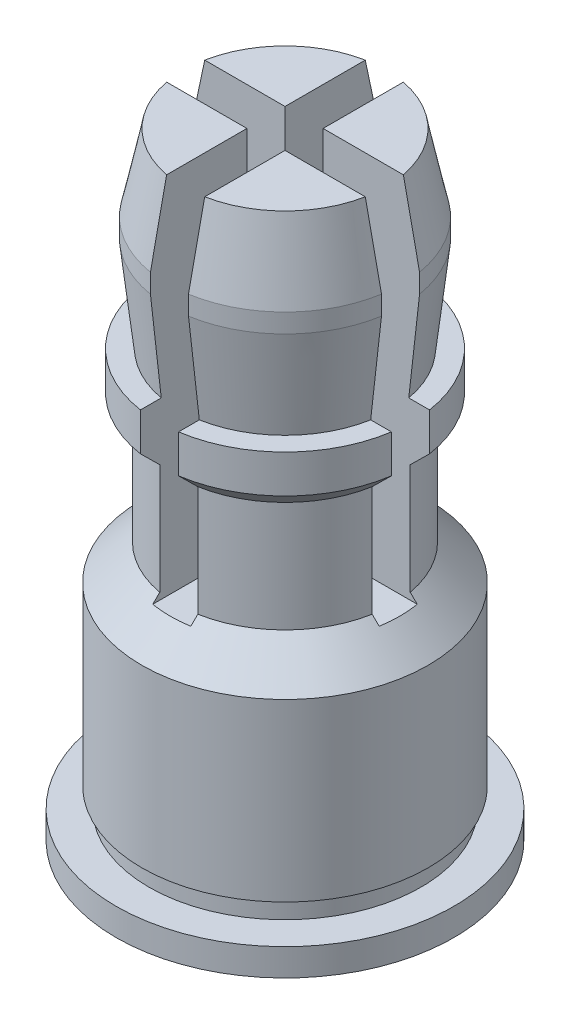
ISO-10303-21;
HEADER;
FILE_DESCRIPTION(('STEP AP214'),'2;1');
FILE_NAME('part.step','',(''),(''),'','','');
FILE_SCHEMA(('AUTOMOTIVE_DESIGN { 1 0 10303 214 1 1 1 1 }'));
ENDSEC;
DATA;
#1=APPLICATION_CONTEXT('core data for automotive mechanical design processes');
#2=APPLICATION_PROTOCOL_DEFINITION('international standard','automotive_design',2000,#1);
#3=PRODUCT_CONTEXT('',#1,'mechanical');
#4=PRODUCT('Part','Part','',(#3));
#5=PRODUCT_RELATED_PRODUCT_CATEGORY('part','',(#4));
#6=PRODUCT_DEFINITION_FORMATION('','',#4);
#7=PRODUCT_DEFINITION_CONTEXT('part definition',#1,'design');
#8=PRODUCT_DEFINITION('design','',#6,#7);
#9=PRODUCT_DEFINITION_SHAPE('','',#8);
#10=(LENGTH_UNIT() NAMED_UNIT(*) SI_UNIT(.MILLI.,.METRE.));
#11=(NAMED_UNIT(*) PLANE_ANGLE_UNIT() SI_UNIT($,.RADIAN.));
#12=(NAMED_UNIT(*) SI_UNIT($,.STERADIAN.) SOLID_ANGLE_UNIT());
#13=UNCERTAINTY_MEASURE_WITH_UNIT(LENGTH_MEASURE(1.E-05),#10,'distance_accuracy_value','');
#14=(GEOMETRIC_REPRESENTATION_CONTEXT(3) GLOBAL_UNCERTAINTY_ASSIGNED_CONTEXT((#13)) GLOBAL_UNIT_ASSIGNED_CONTEXT((#10,
#11,#12)) REPRESENTATION_CONTEXT('',''));
#15=CARTESIAN_POINT('',(0.,0.,0.));
#16=DIRECTION('',(0.,0.,1.));
#17=DIRECTION('',(1.,0.,0.));
#18=AXIS2_PLACEMENT_3D('',#15,#16,#17);
#19=CARTESIAN_POINT('',(0.,6.92674999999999,0.));
#20=DIRECTION('',(0.,1.,0.));
#21=DIRECTION('',(0.,0.,1.));
#22=AXIS2_PLACEMENT_3D('',#19,#20,#21);
#23=CONICAL_SURFACE('',#22,2.02725,0.785398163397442);
#24=CARTESIAN_POINT('',(0.357750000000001,5.34862723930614,0.271533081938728));
#25=CARTESIAN_POINT('',(0.357750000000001,5.36012103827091,0.290503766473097));
#26=CARTESIAN_POINT('',(0.357750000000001,5.37212978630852,0.309146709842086));
#27=CARTESIAN_POINT('',(0.357750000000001,5.3969279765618,0.345889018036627));
#28=CARTESIAN_POINT('',(0.357750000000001,5.40971685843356,0.363988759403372));
#29=CARTESIAN_POINT('',(0.357750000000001,5.43582029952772,0.399751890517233));
#30=CARTESIAN_POINT('',(0.357750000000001,5.44913390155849,0.417415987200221));
#31=CARTESIAN_POINT('',(0.357750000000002,5.47617487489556,0.452429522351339));
#32=CARTESIAN_POINT('',(0.357750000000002,5.48990233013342,0.469778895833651));
#33=CARTESIAN_POINT('',(0.357750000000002,5.53148842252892,0.521384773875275));
#34=CARTESIAN_POINT('',(0.357750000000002,5.55980493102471,0.555271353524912));
#35=CARTESIAN_POINT('',(0.357750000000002,5.61719981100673,0.622419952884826));
#36=CARTESIAN_POINT('',(0.357750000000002,5.64627860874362,0.655681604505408));
#37=CARTESIAN_POINT('',(0.357750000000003,5.73170491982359,0.751960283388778));
#38=CARTESIAN_POINT('',(0.357750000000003,5.78869744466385,0.814403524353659));
#39=CARTESIAN_POINT('',(0.357750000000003,5.90357561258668,0.93846344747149));
#40=CARTESIAN_POINT('',(0.357750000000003,5.96146132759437,1.00008006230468));
#41=CARTESIAN_POINT('',(0.357750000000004,6.077757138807,1.12280442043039));
#42=CARTESIAN_POINT('',(0.357750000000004,6.13616718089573,1.18391221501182));
#43=CARTESIAN_POINT('',(0.357750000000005,6.2533224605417,1.30580590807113));
#44=CARTESIAN_POINT('',(0.357750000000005,6.3120677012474,1.36659180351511));
#45=CARTESIAN_POINT('',(0.357750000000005,6.48898203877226,1.54898660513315));
#46=CARTESIAN_POINT('',(0.357750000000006,6.60748475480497,1.67027171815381));
#47=CARTESIAN_POINT('',(0.357750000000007,6.8449330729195,1.91239789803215));
#48=CARTESIAN_POINT('',(0.357750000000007,6.96387865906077,2.03323898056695));
#49=CARTESIAN_POINT('',(0.357750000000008,7.23297848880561,2.30602780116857));
#50=CARTESIAN_POINT('',(0.357750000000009,7.38321050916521,2.45789881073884));
#51=CARTESIAN_POINT('',(0.35775000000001,7.68391223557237,2.76140928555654));
#52=CARTESIAN_POINT('',(0.35775000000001,7.83438194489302,2.9130487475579));
#53=CARTESIAN_POINT('',(0.357750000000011,8.13483600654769,3.21554401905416));
#54=CARTESIAN_POINT('',(0.357750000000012,8.28481974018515,3.3664004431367));
#55=CARTESIAN_POINT('',(0.357750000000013,8.58488578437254,3.66801043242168));
#56=CARTESIAN_POINT('',(0.357750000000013,8.7349680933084,3.81876399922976));
#57=CARTESIAN_POINT('',(0.357750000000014,8.8850782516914,3.96948975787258));
#58=B_SPLINE_CURVE_WITH_KNOTS('',3,(#24,#25,#26,#27,#28,#29,#30,#31,#32,#33,#34,#35,#36,#37,#38,
#39,#40,#41,#42,#43,#44,#45,#46,#47,#48,#49,#50,#51,#52,#53,#54,#55,#56,#57),.UNSPECIFIED.,.F.,
.F.,(4,2,2,2,2,2,2,2,2,2,2,2,2,2,2,2,4),(0.,0.0665151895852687,0.132983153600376,
0.19933502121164,0.265700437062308,0.398160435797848,0.530696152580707,0.784299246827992,
1.03792287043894,1.29152061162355,1.54512073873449,2.05381877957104,2.56249868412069,
3.20336481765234,3.84423985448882,4.48242082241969,5.12059158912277),.UNSPECIFIED.);
#59=CARTESIAN_POINT('',(0.357750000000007,6.92674999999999,1.99543416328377));
#60=VERTEX_POINT('',#59);
#61=CARTESIAN_POINT('',(0.357750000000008,7.2845,2.35801610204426));
#62=VERTEX_POINT('',#61);
#63=EDGE_CURVE('E572',#60,#62,#58,.T.);
#64=ORIENTED_EDGE('',*,*,#63,.F.);
#65=CARTESIAN_POINT('',(0.,6.92674999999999,0.));
#66=DIRECTION('',(0.,-1.,0.));
#67=DIRECTION('',(0.,0.,-1.));
#68=AXIS2_PLACEMENT_3D('',#65,#66,#67);
#69=CIRCLE('',#68,2.02725);
#70=CARTESIAN_POINT('',(1.99543416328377,6.92674999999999,0.35775));
#71=VERTEX_POINT('',#70);
#72=EDGE_CURVE('E362',#71,#60,#69,.T.);
#73=ORIENTED_EDGE('',*,*,#72,.F.);
#74=CARTESIAN_POINT('',(5.2430470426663,10.1547380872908,0.35775));
#75=CARTESIAN_POINT('',(5.06183974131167,9.97395463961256,0.35775));
#76=CARTESIAN_POINT('',(4.88061398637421,9.79318967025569,0.35775));
#77=CARTESIAN_POINT('',(4.51809714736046,9.43171671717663,0.35775));
#78=CARTESIAN_POINT('',(4.33680606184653,9.25100873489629,0.35775));
#79=CARTESIAN_POINT('',(3.97404117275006,8.88958116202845,0.35775));
#80=CARTESIAN_POINT('',(3.79256732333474,8.70886161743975,0.35775));
#81=CARTESIAN_POINT('',(3.42949454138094,8.34755650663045,0.35775));
#82=CARTESIAN_POINT('',(3.24789561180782,8.16697093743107,0.35775));
#83=CARTESIAN_POINT('',(2.8837822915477,7.80531134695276,0.35775));
#84=CARTESIAN_POINT('',(2.70126708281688,7.62423814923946,0.35775));
#85=CARTESIAN_POINT('',(2.33585760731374,7.26244947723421,0.35775));
#86=CARTESIAN_POINT('',(2.15296331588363,7.08173402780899,0.35775));
#87=CARTESIAN_POINT('',(1.8780756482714,6.81127746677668,0.35775));
#88=CARTESIAN_POINT('',(1.7863709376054,6.72124321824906,0.35775));
#89=CARTESIAN_POINT('',(1.6026522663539,6.54148577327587,0.35775));
#90=CARTESIAN_POINT('',(1.5106382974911,6.45176258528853,0.35775));
#91=CARTESIAN_POINT('',(1.32612251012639,6.27284028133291,0.35775));
#92=CARTESIAN_POINT('',(1.23362075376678,6.18364110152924,0.35775));
#93=CARTESIAN_POINT('',(1.0941643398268,6.05058333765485,0.35775));
#94=CARTESIAN_POINT('',(1.0475625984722,6.00635520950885,0.35775));
#95=CARTESIAN_POINT('',(0.954015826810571,5.91826386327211,0.35775));
#96=CARTESIAN_POINT('',(0.907070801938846,5.87440063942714,0.35775));
#97=CARTESIAN_POINT('',(0.834179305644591,5.80710346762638,0.35775));
#98=CARTESIAN_POINT('',(0.808415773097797,5.78347156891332,0.35775));
#99=CARTESIAN_POINT('',(0.756688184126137,5.73642664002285,0.35775));
#100=CARTESIAN_POINT('',(0.7307241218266,5.71301361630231,0.35775));
#101=CARTESIAN_POINT('',(0.678514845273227,5.66645932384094,0.35775));
#102=CARTESIAN_POINT('',(0.652269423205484,5.64331828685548,0.35775));
#103=CARTESIAN_POINT('',(0.59942751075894,5.5974464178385,0.35775));
#104=CARTESIAN_POINT('',(0.572831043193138,5.57471555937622,0.35775));
#105=CARTESIAN_POINT('',(0.502837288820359,5.51614694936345,0.35775));
#106=CARTESIAN_POINT('',(0.459062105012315,5.48074789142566,0.35775));
#107=CARTESIAN_POINT('',(0.391747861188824,5.42982299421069,0.35775));
#108=CARTESIAN_POINT('',(0.369035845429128,5.4132111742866,0.35775));
#109=CARTESIAN_POINT('',(0.322845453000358,5.38109781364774,0.35775));
#110=CARTESIAN_POINT('',(0.299367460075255,5.3655957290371,0.35775));
#111=CARTESIAN_POINT('',(0.251288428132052,5.33626757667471,0.35775));
#112=CARTESIAN_POINT('',(0.226684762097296,5.32244573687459,0.35775));
#113=CARTESIAN_POINT('',(0.176067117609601,5.29762023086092,0.35775));
#114=CARTESIAN_POINT('',(0.150055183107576,5.28661260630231,0.35775));
#115=CARTESIAN_POINT('',(0.102482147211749,5.27112409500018,0.35775));
#116=CARTESIAN_POINT('',(0.081229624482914,5.26573345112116,0.35775));
#117=CARTESIAN_POINT('',(0.0381416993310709,5.25865591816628,0.35775));
#118=CARTESIAN_POINT('',(0.0163082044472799,5.25695813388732,0.35775));
#119=CARTESIAN_POINT('',(-0.0273459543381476,5.25762699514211,0.35775));
#120=CARTESIAN_POINT('',(-0.049166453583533,5.2600036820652,0.35775));
#121=CARTESIAN_POINT('',(-0.0921317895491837,5.26831478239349,0.35775));
#122=CARTESIAN_POINT('',(-0.113274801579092,5.27425807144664,0.35775));
#123=CARTESIAN_POINT('',(-0.157437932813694,5.28973739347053,0.35775));
#124=CARTESIAN_POINT('',(-0.180319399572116,5.29965357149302,0.35775));
#125=CARTESIAN_POINT('',(-0.225017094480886,5.32168329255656,0.35775));
#126=CARTESIAN_POINT('',(-0.246831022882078,5.33380133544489,0.35775));
#127=CARTESIAN_POINT('',(-0.289784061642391,5.3595677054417,0.35775));
#128=CARTESIAN_POINT('',(-0.310915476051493,5.37322864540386,0.35775));
#129=CARTESIAN_POINT('',(-0.352493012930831,5.40150239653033,0.35775));
#130=CARTESIAN_POINT('',(-0.372939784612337,5.41611426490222,0.35775));
#131=CARTESIAN_POINT('',(-0.437633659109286,5.46394408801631,0.35775));
#132=CARTESIAN_POINT('',(-0.48094716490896,5.49841526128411,0.35775));
#133=CARTESIAN_POINT('',(-0.566296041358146,5.56891379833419,0.35775));
#134=CARTESIAN_POINT('',(-0.608330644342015,5.60494206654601,0.35775));
#135=CARTESIAN_POINT('',(-0.691680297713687,5.67796113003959,0.35775));
#136=CARTESIAN_POINT('',(-0.732994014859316,5.7149534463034,0.35775));
#137=CARTESIAN_POINT('',(-0.815098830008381,5.78948834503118,0.35775));
#138=CARTESIAN_POINT('',(-0.855890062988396,5.82703077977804,0.35775));
#139=CARTESIAN_POINT('',(-0.977380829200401,5.93985764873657,0.35775));
#140=CARTESIAN_POINT('',(-1.05757779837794,6.01568239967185,0.35775));
#141=CARTESIAN_POINT('',(-1.21720660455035,6.16797361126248,0.35775));
#142=CARTESIAN_POINT('',(-1.29663910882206,6.2444393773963,0.35775));
#143=CARTESIAN_POINT('',(-1.45729570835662,6.39992471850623,0.35775));
#144=CARTESIAN_POINT('',(-1.53850826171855,6.47895621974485,0.35775));
#145=CARTESIAN_POINT('',(-1.70066248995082,6.63729677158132,0.35775));
#146=CARTESIAN_POINT('',(-1.78160416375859,6.71660582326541,0.35775));
#147=CARTESIAN_POINT('',(-2.02416586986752,6.95480643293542,0.35775));
#148=CARTESIAN_POINT('',(-2.18551986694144,7.11396879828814,0.35775));
#149=CARTESIAN_POINT('',(-2.50795193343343,7.43272725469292,0.35775));
#150=CARTESIAN_POINT('',(-2.66902983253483,7.5923235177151,0.35775));
#151=CARTESIAN_POINT('',(-2.99097469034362,7.91172612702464,0.35775));
#152=CARTESIAN_POINT('',(-3.15184165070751,8.07153247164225,0.35775));
#153=CARTESIAN_POINT('',(-3.47372226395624,8.39155317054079,0.35775));
#154=CARTESIAN_POINT('',(-3.63473569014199,8.55176775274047,0.35775));
#155=CARTESIAN_POINT('',(-3.95667446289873,8.87228623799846,0.35775));
#156=CARTESIAN_POINT('',(-4.11759980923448,9.03259014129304,0.35775));
#157=CARTESIAN_POINT('',(-4.43930457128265,9.35317600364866,0.35775));
#158=CARTESIAN_POINT('',(-4.60008401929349,9.51345793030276,0.35775));
#159=CARTESIAN_POINT('',(-4.92159639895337,9.83406751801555,0.35775));
#160=CARTESIAN_POINT('',(-5.0823293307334,9.99439517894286,0.35775));
#161=CARTESIAN_POINT('',(-5.2430470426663,10.1547380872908,0.35775));
#162=B_SPLINE_CURVE_WITH_KNOTS('',3,(#74,#75,#76,#77,#78,#79,#80,#81,#82,#83,#84,#85,#86,#87,
#88,#89,#90,#91,#92,#93,#94,#95,#96,#97,#98,#99,#100,#101,#102,#103,#104,#105,#106,#107,#108,
#109,#110,#111,#112,#113,#114,#115,#116,#117,#118,#119,#120,#121,#122,#123,#124,#125,#126,#127,
#128,#129,#130,#131,#132,#133,#134,#135,#136,#137,#138,#139,#140,#141,#142,#143,#144,#145,#146,
#147,#148,#149,#150,#151,#152,#153,#154,#155,#156,#157,#158,#159,#160,#161),.UNSPECIFIED.,.F.,
.F.,(4,2,2,2,2,2,2,2,2,2,2,2,2,2,2,2,2,2,2,2,2,2,2,2,2,2,2,2,2,2,2,2,2,2,2,2,2,2,2,2,2,2,2,4),
(0.,0.76789888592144,1.53581585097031,2.30414570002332,3.07245792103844,3.84375132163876,
4.61509657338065,5.0006388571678,5.38619154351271,5.77169624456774,5.96444016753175,
6.15718104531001,6.26206108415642,6.36694420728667,6.47191102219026,6.57687104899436,
6.74568217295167,6.83007833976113,6.91443285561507,6.99899541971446,7.08343837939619,
7.14896153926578,7.21429111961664,7.27978193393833,7.34543640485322,7.42006846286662,
7.49485479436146,7.57030406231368,7.64567963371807,7.8116566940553,7.97773149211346,
8.14408640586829,8.31039744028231,8.64148774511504,8.97225659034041,9.31221570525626,
9.65217615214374,10.3321084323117,11.0123681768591,11.6926225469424,12.3740521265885,
13.0554835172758,13.736558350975,14.4176312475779),.UNSPECIFIED.);
#163=CARTESIAN_POINT('',(2.35801610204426,7.2845,0.35775));
#164=VERTEX_POINT('',#163);
#165=EDGE_CURVE('E691',#164,#71,#162,.T.);
#166=ORIENTED_EDGE('',*,*,#165,.F.);
#167=CARTESIAN_POINT('',(0.,7.2845,0.));
#168=DIRECTION('',(0.,-1.,0.));
#169=DIRECTION('',(0.,0.,-1.));
#170=AXIS2_PLACEMENT_3D('',#167,#168,#169);
#171=CIRCLE('',#170,2.385);
#172=EDGE_CURVE('E660',#164,#62,#171,.T.);
#173=ORIENTED_EDGE('',*,*,#172,.T.);
#174=EDGE_LOOP('',(#64,#73,#166,#173));
#175=FACE_BOUND('',#174,.T.);
#176=ADVANCED_FACE('F39',(#175),#23,.T.);
#177=CARTESIAN_POINT('',(0.,0.,0.));
#178=DIRECTION('',(0.,-1.,0.));
#179=DIRECTION('',(0.,0.,-1.));
#180=AXIS2_PLACEMENT_3D('',#177,#178,#179);
#181=CYLINDRICAL_SURFACE('',#180,2.02725);
#182=DIRECTION('',(0.,-1.,0.));
#183=VECTOR('',#182,1.);
#184=CARTESIAN_POINT('',(0.357750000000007,0.,1.99543416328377));
#185=LINE('',#184,#183);
#186=CARTESIAN_POINT('',(0.357750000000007,4.8518,1.99543416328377));
#187=VERTEX_POINT('',#186);
#188=EDGE_CURVE('E1034',#187,#60,#185,.F.);
#189=ORIENTED_EDGE('',*,*,#188,.F.);
#190=CARTESIAN_POINT('',(0.,4.8518,0.));
#191=DIRECTION('',(0.,-1.,0.));
#192=DIRECTION('',(0.,0.,-1.));
#193=AXIS2_PLACEMENT_3D('',#190,#191,#192);
#194=CIRCLE('',#193,2.02725);
#195=CARTESIAN_POINT('',(1.99543416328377,4.8518,0.35775));
#196=VERTEX_POINT('',#195);
#197=EDGE_CURVE('E356',#196,#187,#194,.T.);
#198=ORIENTED_EDGE('',*,*,#197,.F.);
#199=DIRECTION('',(0.,-1.,0.));
#200=VECTOR('',#199,1.);
#201=CARTESIAN_POINT('',(1.99543416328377,0.,0.35775));
#202=LINE('',#201,#200);
#203=EDGE_CURVE('E688',#71,#196,#202,.T.);
#204=ORIENTED_EDGE('',*,*,#203,.F.);
#205=ORIENTED_EDGE('',*,*,#72,.T.);
#206=EDGE_LOOP('',(#189,#198,#204,#205));
#207=FACE_BOUND('',#206,.T.);
#208=ADVANCED_FACE('F729',(#207),#181,.T.);
#209=CARTESIAN_POINT('',(1.9,11.58,0.));
#210=DIRECTION('',(0.,1.,0.));
#211=DIRECTION('',(0.,0.,1.));
#212=AXIS2_PLACEMENT_3D('',#209,#210,#211);
#213=PLANE('',#212);
#214=DIRECTION('',(0.,0.,-1.));
#215=VECTOR('',#214,1.);
#216=CARTESIAN_POINT('',(0.357749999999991,11.58,-2.66610482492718));
#217=LINE('',#216,#215);
#218=CARTESIAN_POINT('',(0.357750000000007,11.58,1.8660157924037));
#219=VERTEX_POINT('',#218);
#220=CARTESIAN_POINT('',(0.357750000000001,11.58,0.35775));
#221=VERTEX_POINT('',#220);
#222=EDGE_CURVE('E998',#219,#221,#217,.T.);
#223=ORIENTED_EDGE('',*,*,#222,.F.);
#224=CARTESIAN_POINT('',(0.,11.58,0.));
#225=DIRECTION('',(0.,-1.,0.));
#226=DIRECTION('',(0.,0.,-1.));
#227=AXIS2_PLACEMENT_3D('',#224,#225,#226);
#228=CIRCLE('',#227,1.9);
#229=CARTESIAN_POINT('',(1.8660157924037,11.58,0.35775));
#230=VERTEX_POINT('',#229);
#231=EDGE_CURVE('E322',#230,#219,#228,.T.);
#232=ORIENTED_EDGE('',*,*,#231,.F.);
#233=DIRECTION('',(1.,0.,0.));
#234=VECTOR('',#233,1.);
#235=CARTESIAN_POINT('',(2.66610482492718,11.58,0.35775));
#236=LINE('',#235,#234);
#237=EDGE_CURVE('E956',#221,#230,#236,.T.);
#238=ORIENTED_EDGE('',*,*,#237,.F.);
#239=EDGE_LOOP('',(#223,#232,#238));
#240=FACE_BOUND('',#239,.T.);
#241=ADVANCED_FACE('F736',(#240),#213,.T.);
#242=CARTESIAN_POINT('',(0.,10.148,0.));
#243=DIRECTION('',(0.,-1.,0.));
#244=DIRECTION('',(0.,0.,-1.));
#245=AXIS2_PLACEMENT_3D('',#242,#243,#244);
#246=CONICAL_SURFACE('',#245,2.2,0.206510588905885);
#247=CARTESIAN_POINT('',(0.35775000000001,7.08978562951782,2.81807020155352));
#248=CARTESIAN_POINT('',(0.357750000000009,7.66346142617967,2.69690537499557));
#249=CARTESIAN_POINT('',(0.357750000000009,8.23711864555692,2.57565216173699));
#250=CARTESIAN_POINT('',(0.357750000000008,9.38435456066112,2.3327787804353));
#251=CARTESIAN_POINT('',(0.357750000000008,9.95793325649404,2.21115861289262));
#252=CARTESIAN_POINT('',(0.357750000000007,11.1049730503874,1.96736065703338));
#253=CARTESIAN_POINT('',(0.357750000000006,11.678434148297,1.84518286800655));
#254=CARTESIAN_POINT('',(0.357750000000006,12.5384653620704,1.66116391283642));
#255=CARTESIAN_POINT('',(0.357750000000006,12.8251158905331,1.59969884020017));
#256=CARTESIAN_POINT('',(0.357750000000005,13.3983377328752,1.47639964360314));
#257=CARTESIAN_POINT('',(0.357750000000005,13.684909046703,1.41456551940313));
#258=CARTESIAN_POINT('',(0.357750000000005,13.9714277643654,1.35248774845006));
#259=B_SPLINE_CURVE_WITH_KNOTS('',3,(#247,#248,#249,#250,#251,#252,#253,#254,#255,#256,#257,
#258),.UNSPECIFIED.,.F.,.F.,(4,2,2,2,2,4),(0.,1.75899514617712,3.51798789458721,
5.27698288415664,6.15648158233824,7.03598085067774),.UNSPECIFIED.);
#260=CARTESIAN_POINT('',(0.357750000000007,10.148,2.17071760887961));
#261=VERTEX_POINT('',#260);
#262=EDGE_CURVE('E587',#261,#219,#259,.T.);
#263=ORIENTED_EDGE('',*,*,#262,.F.);
#264=CARTESIAN_POINT('',(0.,10.148,0.));
#265=DIRECTION('',(0.,-1.,0.));
#266=DIRECTION('',(0.,0.,-1.));
#267=AXIS2_PLACEMENT_3D('',#264,#265,#266);
#268=CIRCLE('',#267,2.2);
#269=CARTESIAN_POINT('',(2.17071760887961,10.148,0.35775));
#270=VERTEX_POINT('',#269);
#271=EDGE_CURVE('E323',#270,#261,#268,.T.);
#272=ORIENTED_EDGE('',*,*,#271,.F.);
#273=CARTESIAN_POINT('',(1.29409597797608,14.2404876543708,0.35775));
#274=CARTESIAN_POINT('',(1.37294617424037,13.877560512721,0.35775));
#275=CARTESIAN_POINT('',(1.45137603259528,13.5145425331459,0.35775));
#276=CARTESIAN_POINT('',(1.60762788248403,12.7883761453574,0.35775));
#277=CARTESIAN_POINT('',(1.68544987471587,12.4252277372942,0.35775));
#278=CARTESIAN_POINT('',(1.84305752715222,11.6879107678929,0.35775));
#279=CARTESIAN_POINT('',(1.92283172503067,11.3137397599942,0.35775));
#280=CARTESIAN_POINT('',(2.11959572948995,10.3891820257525,0.35775));
#281=CARTESIAN_POINT('',(2.23642610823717,9.83876137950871,0.35775));
#282=CARTESIAN_POINT('',(2.4697031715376,8.73783932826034,0.35775));
#283=CARTESIAN_POINT('',(2.58614985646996,8.18733792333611,0.35775));
#284=CARTESIAN_POINT('',(2.70250945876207,7.63681829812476,0.35775));
#285=B_SPLINE_CURVE_WITH_KNOTS('',3,(#273,#274,#275,#276,#277,#278,#279,#280,#281,#282,#283,
#284),.UNSPECIFIED.,.F.,.F.,(4,2,2,2,2,4),(0.,1.11418091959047,2.22836055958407,
3.37610206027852,5.06415103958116,6.75219835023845),.UNSPECIFIED.);
#286=EDGE_CURVE('E611',#230,#270,#285,.T.);
#287=ORIENTED_EDGE('',*,*,#286,.F.);
#288=ORIENTED_EDGE('',*,*,#231,.T.);
#289=EDGE_LOOP('',(#263,#272,#287,#288));
#290=FACE_BOUND('',#289,.T.);
#291=ADVANCED_FACE('F597',(#290),#246,.T.);
#292=CARTESIAN_POINT('',(0.,0.,0.));
#293=DIRECTION('',(0.,-1.,0.));
#294=DIRECTION('',(0.,0.,-1.));
#295=AXIS2_PLACEMENT_3D('',#292,#293,#294);
#296=CYLINDRICAL_SURFACE('',#295,2.2);
#297=DIRECTION('',(0.,-1.,0.));
#298=VECTOR('',#297,1.);
#299=CARTESIAN_POINT('',(0.357750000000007,0.,2.17071760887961));
#300=LINE('',#299,#298);
#301=CARTESIAN_POINT('',(0.357750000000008,9.79,2.17071760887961));
#302=VERTEX_POINT('',#301);
#303=EDGE_CURVE('E585',#302,#261,#300,.F.);
#304=ORIENTED_EDGE('',*,*,#303,.F.);
#305=CARTESIAN_POINT('',(0.,9.79,0.));
#306=DIRECTION('',(0.,-1.,0.));
#307=DIRECTION('',(0.,0.,-1.));
#308=AXIS2_PLACEMENT_3D('',#305,#306,#307);
#309=CIRCLE('',#308,2.2);
#310=CARTESIAN_POINT('',(2.17071760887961,9.79,0.35775));
#311=VERTEX_POINT('',#310);
#312=EDGE_CURVE('E923',#311,#302,#309,.T.);
#313=ORIENTED_EDGE('',*,*,#312,.F.);
#314=DIRECTION('',(0.,-1.,0.));
#315=VECTOR('',#314,1.);
#316=CARTESIAN_POINT('',(2.17071760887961,0.,0.35775));
#317=LINE('',#316,#315);
#318=EDGE_CURVE('E1028',#270,#311,#317,.T.);
#319=ORIENTED_EDGE('',*,*,#318,.F.);
#320=ORIENTED_EDGE('',*,*,#271,.T.);
#321=EDGE_LOOP('',(#304,#313,#319,#320));
#322=FACE_BOUND('',#321,.T.);
#323=ADVANCED_FACE('F792',(#322),#296,.T.);
#324=CARTESIAN_POINT('',(0.,8.,0.));
#325=DIRECTION('',(0.,1.,0.));
#326=DIRECTION('',(0.,0.,1.));
#327=AXIS2_PLACEMENT_3D('',#324,#325,#326);
#328=CONICAL_SURFACE('',#327,2.,0.111270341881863);
#329=CARTESIAN_POINT('',(0.357750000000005,4.59986696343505,1.58010404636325));
#330=CARTESIAN_POINT('',(0.357750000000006,5.56567365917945,1.69071320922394));
#331=CARTESIAN_POINT('',(0.357750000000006,6.53153504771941,1.80084273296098));
#332=CARTESIAN_POINT('',(0.357750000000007,7.73866140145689,1.93806523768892));
#333=CARTESIAN_POINT('',(0.357750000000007,7.97989127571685,1.96546673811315));
#334=CARTESIAN_POINT('',(0.357750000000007,9.42827149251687,2.12987889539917));
#335=CARTESIAN_POINT('',(0.357750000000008,10.6354714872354,2.2664525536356));
#336=CARTESIAN_POINT('',(0.357750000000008,11.8426894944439,2.40286498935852));
#337=B_SPLINE_CURVE_WITH_KNOTS('',3,(#329,#330,#331,#332,#333,#334,#335,#336),.UNSPECIFIED.,.F.,
.F.,(4,2,2,4),(0.,2.91635904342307,3.64470253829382,7.28940479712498),.UNSPECIFIED.);
#338=CARTESIAN_POINT('',(0.357750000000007,8.,1.9677436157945));
#339=VERTEX_POINT('',#338);
#340=EDGE_CURVE('E578',#339,#302,#337,.T.);
#341=ORIENTED_EDGE('',*,*,#340,.F.);
#342=CARTESIAN_POINT('',(0.,8.,0.));
#343=DIRECTION('',(0.,-1.,0.));
#344=DIRECTION('',(0.,0.,-1.));
#345=AXIS2_PLACEMENT_3D('',#342,#343,#344);
#346=CIRCLE('',#345,2.);
#347=CARTESIAN_POINT('',(1.9677436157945,8.,0.35775));
#348=VERTEX_POINT('',#347);
#349=EDGE_CURVE('E935',#348,#339,#346,.T.);
#350=ORIENTED_EDGE('',*,*,#349,.F.);
#351=CARTESIAN_POINT('',(2.42791016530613,12.0644247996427,0.35775));
#352=CARTESIAN_POINT('',(2.35904162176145,11.4546566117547,0.35775));
#353=CARTESIAN_POINT('',(2.29011629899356,10.8448948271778,0.35775));
#354=CARTESIAN_POINT('',(2.15210366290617,9.6253896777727,0.35775));
#355=CARTESIAN_POINT('',(2.08301634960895,9.01564631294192,0.35775));
#356=CARTESIAN_POINT('',(1.94463127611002,7.796183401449,0.35775));
#357=CARTESIAN_POINT('',(1.87533351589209,7.18646385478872,0.35775));
#358=CARTESIAN_POINT('',(1.73643524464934,5.96705916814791,0.35775));
#359=CARTESIAN_POINT('',(1.66683473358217,5.35737402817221,0.35775));
#360=CARTESIAN_POINT('',(1.59703670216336,4.74771144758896,0.35775));
#361=B_SPLINE_CURVE_WITH_KNOTS('',3,(#351,#352,#353,#354,#355,#356,#357,#358,#359,#360),
.UNSPECIFIED.,.F.,.F.,(4,2,2,2,4),(0.,1.84093484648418,3.68186943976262,5.52280417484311,
7.36373916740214),.UNSPECIFIED.);
#362=EDGE_CURVE('E409',#311,#348,#361,.T.);
#363=ORIENTED_EDGE('',*,*,#362,.F.);
#364=ORIENTED_EDGE('',*,*,#312,.T.);
#365=EDGE_LOOP('',(#341,#350,#363,#364));
#366=FACE_BOUND('',#365,.T.);
#367=ADVANCED_FACE('F484',(#366),#328,.T.);
#368=CARTESIAN_POINT('',(2.385,8.,0.));
#369=DIRECTION('',(0.,1.,0.));
#370=DIRECTION('',(0.,0.,1.));
#371=AXIS2_PLACEMENT_3D('',#368,#369,#370);
#372=PLANE('',#371);
#373=DIRECTION('',(0.,0.,-1.));
#374=VECTOR('',#373,1.);
#375=CARTESIAN_POINT('',(0.35775,8.,0.));
#376=LINE('',#375,#374);
#377=CARTESIAN_POINT('',(0.357750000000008,8.,2.35801610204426));
#378=VERTEX_POINT('',#377);
#379=EDGE_CURVE('E586',#378,#339,#376,.T.);
#380=ORIENTED_EDGE('',*,*,#379,.F.);
#381=CARTESIAN_POINT('',(0.,8.,0.));
#382=DIRECTION('',(0.,-1.,0.));
#383=DIRECTION('',(0.,0.,-1.));
#384=AXIS2_PLACEMENT_3D('',#381,#382,#383);
#385=CIRCLE('',#384,2.385);
#386=CARTESIAN_POINT('',(2.35801610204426,8.,0.35775));
#387=VERTEX_POINT('',#386);
#388=EDGE_CURVE('E662',#387,#378,#385,.T.);
#389=ORIENTED_EDGE('',*,*,#388,.F.);
#390=DIRECTION('',(1.,0.,0.));
#391=VECTOR('',#390,1.);
#392=CARTESIAN_POINT('',(2.385,8.,0.35775));
#393=LINE('',#392,#391);
#394=EDGE_CURVE('E405',#348,#387,#393,.T.);
#395=ORIENTED_EDGE('',*,*,#394,.F.);
#396=ORIENTED_EDGE('',*,*,#349,.T.);
#397=EDGE_LOOP('',(#380,#389,#395,#396));
#398=FACE_BOUND('',#397,.T.);
#399=ADVANCED_FACE('F776',(#398),#372,.T.);
#400=CARTESIAN_POINT('',(0.,0.,0.));
#401=DIRECTION('',(0.,-1.,0.));
#402=DIRECTION('',(0.,0.,-1.));
#403=AXIS2_PLACEMENT_3D('',#400,#401,#402);
#404=CYLINDRICAL_SURFACE('',#403,2.385);
#405=DIRECTION('',(0.,-1.,0.));
#406=VECTOR('',#405,1.);
#407=CARTESIAN_POINT('',(0.357750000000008,0.,2.35801610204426));
#408=LINE('',#407,#406);
#409=EDGE_CURVE('E1033',#62,#378,#408,.F.);
#410=ORIENTED_EDGE('',*,*,#409,.F.);
#411=ORIENTED_EDGE('',*,*,#172,.F.);
#412=DIRECTION('',(0.,-1.,0.));
#413=VECTOR('',#412,1.);
#414=CARTESIAN_POINT('',(2.35801610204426,0.,0.35775));
#415=LINE('',#414,#413);
#416=EDGE_CURVE('E368',#387,#164,#415,.T.);
#417=ORIENTED_EDGE('',*,*,#416,.F.);
#418=ORIENTED_EDGE('',*,*,#388,.T.);
#419=EDGE_LOOP('',(#410,#411,#417,#418));
#420=FACE_BOUND('',#419,.T.);
#421=ADVANCED_FACE('F726',(#420),#404,.T.);
#422=CARTESIAN_POINT('',(0.357749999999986,8.8850782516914,-3.96948975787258));
#423=CARTESIAN_POINT('',(0.357749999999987,8.73461401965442,-3.81840837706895));
#424=CARTESIAN_POINT('',(0.357749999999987,8.58417770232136,-3.66729912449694));
#425=CARTESIAN_POINT('',(0.357749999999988,8.28342575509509,-3.36499883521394));
#426=CARTESIAN_POINT('',(0.357749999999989,8.13311011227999,-3.21380781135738));
#427=CARTESIAN_POINT('',(0.35774999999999,7.83267855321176,-2.91133236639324));
#428=CARTESIAN_POINT('',(0.35774999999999,7.68256258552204,-2.76004799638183));
#429=CARTESIAN_POINT('',(0.357749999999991,7.38254674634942,-2.45722785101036));
#430=CARTESIAN_POINT('',(0.357749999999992,7.2326469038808,-2.30569204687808));
#431=CARTESIAN_POINT('',(0.357749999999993,7.00805704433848,-2.07802280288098));
#432=CARTESIAN_POINT('',(0.357749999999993,6.93320988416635,-2.00204441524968));
#433=CARTESIAN_POINT('',(0.357749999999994,6.78366772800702,-1.84994529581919));
#434=CARTESIAN_POINT('',(0.357749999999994,6.7089727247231,-1.77382457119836));
#435=CARTESIAN_POINT('',(0.357749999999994,6.55982585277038,-1.62140177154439));
#436=CARTESIAN_POINT('',(0.357749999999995,6.48537390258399,-1.54509977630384));
#437=CARTESIAN_POINT('',(0.357749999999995,6.33678181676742,-1.39216600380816));
#438=CARTESIAN_POINT('',(0.357749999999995,6.26264173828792,-1.31553417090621));
#439=CARTESIAN_POINT('',(0.357749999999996,6.15178738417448,-1.20014608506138));
#440=CARTESIAN_POINT('',(0.357749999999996,6.11487083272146,-1.16158424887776));
#441=CARTESIAN_POINT('',(0.357749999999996,6.04122179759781,-1.084288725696));
#442=CARTESIAN_POINT('',(0.357749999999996,6.00448930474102,-1.04555504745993));
#443=CARTESIAN_POINT('',(0.357749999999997,5.9312941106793,-0.967875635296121));
#444=CARTESIAN_POINT('',(0.357749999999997,5.89483126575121,-0.928930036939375));
#445=CARTESIAN_POINT('',(0.357749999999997,5.82225072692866,-0.850704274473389));
#446=CARTESIAN_POINT('',(0.357749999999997,5.78613309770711,-0.811424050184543));
#447=CARTESIAN_POINT('',(0.357749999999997,5.71434867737,-0.732305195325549));
#448=CARTESIAN_POINT('',(0.357749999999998,5.67868296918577,-0.692465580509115));
#449=CARTESIAN_POINT('',(0.357749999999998,5.60819244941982,-0.612077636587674));
#450=CARTESIAN_POINT('',(0.357749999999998,5.57336721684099,-0.571529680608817));
#451=CARTESIAN_POINT('',(0.357749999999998,5.52216509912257,-0.509762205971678));
#452=CARTESIAN_POINT('',(0.357749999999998,5.5052506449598,-0.488989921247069));
#453=CARTESIAN_POINT('',(0.357749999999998,5.47193031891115,-0.447049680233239));
#454=CARTESIAN_POINT('',(0.357749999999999,5.45552431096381,-0.425881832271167));
#455=CARTESIAN_POINT('',(0.357749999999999,5.42337975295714,-0.382976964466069));
#456=CARTESIAN_POINT('',(0.357749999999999,5.40764247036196,-0.361238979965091));
#457=CARTESIAN_POINT('',(0.357749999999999,5.37723426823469,-0.317003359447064));
#458=CARTESIAN_POINT('',(0.357749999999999,5.36256437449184,-0.294505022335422));
#459=CARTESIAN_POINT('',(0.357749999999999,5.34862723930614,-0.271533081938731));
#460=B_SPLINE_CURVE_WITH_KNOTS('',3,(#422,#423,#424,#425,#426,#427,#428,#429,#430,#431,#432,
#433,#434,#435,#436,#437,#438,#439,#440,#441,#442,#443,#444,#445,#446,#447,#448,#449,#450,#451,
#452,#453,#454,#455,#456,#457,#458,#459),.UNSPECIFIED.,.F.,.F.,(4,2,2,2,2,2,2,2,2,2,2,2,2,2,2,2,
2,2,4),(0.,0.639676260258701,1.27927111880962,1.91864248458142,2.55809290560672,
2.87805107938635,3.19799353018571,3.51781455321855,3.83769183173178,3.99784329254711,
4.15798667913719,4.31803746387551,4.47811766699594,4.63852788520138,4.79885601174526,
4.87921346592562,4.9595492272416,5.04003101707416,5.12058915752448),.UNSPECIFIED.);
#461=CARTESIAN_POINT('',(0.357749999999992,7.2845,-2.35801610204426));
#462=VERTEX_POINT('',#461);
#463=CARTESIAN_POINT('',(0.357749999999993,6.92674999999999,-1.99543416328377));
#464=VERTEX_POINT('',#463);
#465=EDGE_CURVE('E557',#462,#464,#460,.T.);
#466=ORIENTED_EDGE('',*,*,#465,.F.);
#467=CARTESIAN_POINT('',(2.35801610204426,7.2845,-0.35775));
#468=VERTEX_POINT('',#467);
#469=EDGE_CURVE('E656',#462,#468,#171,.T.);
#470=ORIENTED_EDGE('',*,*,#469,.T.);
#471=CARTESIAN_POINT('',(-5.2430470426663,10.1547380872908,-0.35775));
#472=CARTESIAN_POINT('',(-5.06183974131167,9.97395463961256,-0.35775));
#473=CARTESIAN_POINT('',(-4.88061398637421,9.79318967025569,-0.35775));
#474=CARTESIAN_POINT('',(-4.51809714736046,9.43171671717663,-0.35775));
#475=CARTESIAN_POINT('',(-4.33680606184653,9.25100873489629,-0.35775));
#476=CARTESIAN_POINT('',(-3.97404117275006,8.88958116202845,-0.35775));
#477=CARTESIAN_POINT('',(-3.79256732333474,8.70886161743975,-0.35775));
#478=CARTESIAN_POINT('',(-3.42949454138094,8.34755650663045,-0.35775));
#479=CARTESIAN_POINT('',(-3.24789561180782,8.16697093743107,-0.35775));
#480=CARTESIAN_POINT('',(-2.8837822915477,7.80531134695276,-0.35775));
#481=CARTESIAN_POINT('',(-2.70126708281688,7.62423814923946,-0.35775));
#482=CARTESIAN_POINT('',(-2.33585760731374,7.26244947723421,-0.35775));
#483=CARTESIAN_POINT('',(-2.15296331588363,7.08173402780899,-0.35775));
#484=CARTESIAN_POINT('',(-1.8780756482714,6.81127746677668,-0.35775));
#485=CARTESIAN_POINT('',(-1.7863709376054,6.72124321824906,-0.35775));
#486=CARTESIAN_POINT('',(-1.6026522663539,6.54148577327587,-0.35775));
#487=CARTESIAN_POINT('',(-1.5106382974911,6.45176258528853,-0.35775));
#488=CARTESIAN_POINT('',(-1.32612251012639,6.27284028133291,-0.35775));
#489=CARTESIAN_POINT('',(-1.23362075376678,6.18364110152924,-0.35775));
#490=CARTESIAN_POINT('',(-1.0941643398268,6.05058333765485,-0.35775));
#491=CARTESIAN_POINT('',(-1.0475625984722,6.00635520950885,-0.35775));
#492=CARTESIAN_POINT('',(-0.954015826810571,5.91826386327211,-0.35775));
#493=CARTESIAN_POINT('',(-0.907070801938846,5.87440063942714,-0.35775));
#494=CARTESIAN_POINT('',(-0.834179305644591,5.80710346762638,-0.35775));
#495=CARTESIAN_POINT('',(-0.808415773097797,5.78347156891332,-0.35775));
#496=CARTESIAN_POINT('',(-0.756688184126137,5.73642664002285,-0.35775));
#497=CARTESIAN_POINT('',(-0.7307241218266,5.71301361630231,-0.35775));
#498=CARTESIAN_POINT('',(-0.678514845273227,5.66645932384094,-0.35775));
#499=CARTESIAN_POINT('',(-0.652269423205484,5.64331828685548,-0.35775));
#500=CARTESIAN_POINT('',(-0.59942751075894,5.5974464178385,-0.35775));
#501=CARTESIAN_POINT('',(-0.572831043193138,5.57471555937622,-0.35775));
#502=CARTESIAN_POINT('',(-0.502837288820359,5.51614694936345,-0.35775));
#503=CARTESIAN_POINT('',(-0.459062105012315,5.48074789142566,-0.35775));
#504=CARTESIAN_POINT('',(-0.391747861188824,5.42982299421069,-0.35775));
#505=CARTESIAN_POINT('',(-0.369035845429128,5.4132111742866,-0.35775));
#506=CARTESIAN_POINT('',(-0.322845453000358,5.38109781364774,-0.35775));
#507=CARTESIAN_POINT('',(-0.299367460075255,5.3655957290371,-0.35775));
#508=CARTESIAN_POINT('',(-0.251288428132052,5.33626757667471,-0.35775));
#509=CARTESIAN_POINT('',(-0.226684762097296,5.32244573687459,-0.35775));
#510=CARTESIAN_POINT('',(-0.176067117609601,5.29762023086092,-0.35775));
#511=CARTESIAN_POINT('',(-0.150055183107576,5.28661260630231,-0.35775));
#512=CARTESIAN_POINT('',(-0.102482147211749,5.27112409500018,-0.35775));
#513=CARTESIAN_POINT('',(-0.081229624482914,5.26573345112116,-0.35775));
#514=CARTESIAN_POINT('',(-0.0381416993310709,5.25865591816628,-0.35775));
#515=CARTESIAN_POINT('',(-0.0163082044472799,5.25695813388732,-0.35775));
#516=CARTESIAN_POINT('',(0.0273459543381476,5.25762699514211,-0.35775));
#517=CARTESIAN_POINT('',(0.049166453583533,5.2600036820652,-0.35775));
#518=CARTESIAN_POINT('',(0.0921317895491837,5.26831478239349,-0.35775));
#519=CARTESIAN_POINT('',(0.113274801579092,5.27425807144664,-0.35775));
#520=CARTESIAN_POINT('',(0.157437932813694,5.28973739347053,-0.35775));
#521=CARTESIAN_POINT('',(0.180319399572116,5.29965357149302,-0.35775));
#522=CARTESIAN_POINT('',(0.225017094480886,5.32168329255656,-0.35775));
#523=CARTESIAN_POINT('',(0.246831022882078,5.33380133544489,-0.35775));
#524=CARTESIAN_POINT('',(0.289784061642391,5.3595677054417,-0.35775));
#525=CARTESIAN_POINT('',(0.310915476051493,5.37322864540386,-0.35775));
#526=CARTESIAN_POINT('',(0.352493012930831,5.40150239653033,-0.35775));
#527=CARTESIAN_POINT('',(0.372939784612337,5.41611426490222,-0.35775));
#528=CARTESIAN_POINT('',(0.437633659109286,5.46394408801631,-0.35775));
#529=CARTESIAN_POINT('',(0.48094716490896,5.49841526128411,-0.35775));
#530=CARTESIAN_POINT('',(0.566296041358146,5.56891379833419,-0.35775));
#531=CARTESIAN_POINT('',(0.608330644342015,5.60494206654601,-0.35775));
#532=CARTESIAN_POINT('',(0.691680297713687,5.67796113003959,-0.35775));
#533=CARTESIAN_POINT('',(0.732994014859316,5.7149534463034,-0.35775));
#534=CARTESIAN_POINT('',(0.815098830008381,5.78948834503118,-0.35775));
#535=CARTESIAN_POINT('',(0.855890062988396,5.82703077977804,-0.35775));
#536=CARTESIAN_POINT('',(0.977380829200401,5.93985764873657,-0.35775));
#537=CARTESIAN_POINT('',(1.05757779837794,6.01568239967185,-0.35775));
#538=CARTESIAN_POINT('',(1.21720660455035,6.16797361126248,-0.35775));
#539=CARTESIAN_POINT('',(1.29663910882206,6.2444393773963,-0.35775));
#540=CARTESIAN_POINT('',(1.45729570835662,6.39992471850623,-0.35775));
#541=CARTESIAN_POINT('',(1.53850826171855,6.47895621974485,-0.35775));
#542=CARTESIAN_POINT('',(1.70066248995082,6.63729677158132,-0.35775));
#543=CARTESIAN_POINT('',(1.78160416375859,6.71660582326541,-0.35775));
#544=CARTESIAN_POINT('',(2.02416586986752,6.95480643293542,-0.35775));
#545=CARTESIAN_POINT('',(2.18551986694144,7.11396879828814,-0.35775));
#546=CARTESIAN_POINT('',(2.50795193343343,7.43272725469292,-0.35775));
#547=CARTESIAN_POINT('',(2.66902983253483,7.5923235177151,-0.35775));
#548=CARTESIAN_POINT('',(2.99097469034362,7.91172612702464,-0.35775));
#549=CARTESIAN_POINT('',(3.15184165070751,8.07153247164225,-0.35775));
#550=CARTESIAN_POINT('',(3.47372226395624,8.39155317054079,-0.35775));
#551=CARTESIAN_POINT('',(3.63473569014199,8.55176775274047,-0.35775));
#552=CARTESIAN_POINT('',(3.95667446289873,8.87228623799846,-0.35775));
#553=CARTESIAN_POINT('',(4.11759980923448,9.03259014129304,-0.35775));
#554=CARTESIAN_POINT('',(4.43930457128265,9.35317600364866,-0.35775));
#555=CARTESIAN_POINT('',(4.60008401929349,9.51345793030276,-0.35775));
#556=CARTESIAN_POINT('',(4.92159639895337,9.83406751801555,-0.35775));
#557=CARTESIAN_POINT('',(5.0823293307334,9.99439517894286,-0.35775));
#558=CARTESIAN_POINT('',(5.2430470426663,10.1547380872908,-0.35775));
#559=B_SPLINE_CURVE_WITH_KNOTS('',3,(#471,#472,#473,#474,#475,#476,#477,#478,#479,#480,#481,
#482,#483,#484,#485,#486,#487,#488,#489,#490,#491,#492,#493,#494,#495,#496,#497,#498,#499,#500,
#501,#502,#503,#504,#505,#506,#507,#508,#509,#510,#511,#512,#513,#514,#515,#516,#517,#518,#519,
#520,#521,#522,#523,#524,#525,#526,#527,#528,#529,#530,#531,#532,#533,#534,#535,#536,#537,#538,
#539,#540,#541,#542,#543,#544,#545,#546,#547,#548,#549,#550,#551,#552,#553,#554,#555,#556,#557,
#558),.UNSPECIFIED.,.F.,.F.,(4,2,2,2,2,2,2,2,2,2,2,2,2,2,2,2,2,2,2,2,2,2,2,2,2,2,2,2,2,2,2,2,2,
2,2,2,2,2,2,2,2,2,2,4),(0.,0.76789888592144,1.53581585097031,2.30414570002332,3.07245792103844,
3.84375132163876,4.61509657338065,5.0006388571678,5.38619154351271,5.77169624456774,
5.96444016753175,6.15718104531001,6.26206108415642,6.36694420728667,6.47191102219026,
6.57687104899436,6.74568217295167,6.83007833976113,6.91443285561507,6.99899541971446,
7.08343837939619,7.14896153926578,7.21429111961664,7.27978193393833,7.34543640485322,
7.42006846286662,7.49485479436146,7.57030406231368,7.64567963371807,7.8116566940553,
7.97773149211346,8.14408640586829,8.31039744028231,8.64148774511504,8.97225659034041,
9.31221570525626,9.65217615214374,10.3321084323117,11.0123681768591,11.6926225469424,
12.3740521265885,13.0554835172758,13.736558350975,14.4176312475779),.UNSPECIFIED.);
#560=CARTESIAN_POINT('',(1.99543416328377,6.92674999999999,-0.35775));
#561=VERTEX_POINT('',#560);
#562=EDGE_CURVE('E412',#561,#468,#559,.T.);
#563=ORIENTED_EDGE('',*,*,#562,.F.);
#564=EDGE_CURVE('E361',#464,#561,#69,.T.);
#565=ORIENTED_EDGE('',*,*,#564,.F.);
#566=EDGE_LOOP('',(#466,#470,#563,#565));
#567=FACE_BOUND('',#566,.T.);
#568=ADVANCED_FACE('F731',(#567),#23,.T.);
#569=DIRECTION('',(0.,-1.,0.));
#570=VECTOR('',#569,1.);
#571=CARTESIAN_POINT('',(0.357749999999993,0.,-1.99543416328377));
#572=LINE('',#571,#570);
#573=CARTESIAN_POINT('',(0.357749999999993,4.8518,-1.99543416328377));
#574=VERTEX_POINT('',#573);
#575=EDGE_CURVE('E951',#464,#574,#572,.T.);
#576=ORIENTED_EDGE('',*,*,#575,.F.);
#577=ORIENTED_EDGE('',*,*,#564,.T.);
#578=DIRECTION('',(0.,-1.,0.));
#579=VECTOR('',#578,1.);
#580=CARTESIAN_POINT('',(1.99543416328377,0.,-0.35775));
#581=LINE('',#580,#579);
#582=CARTESIAN_POINT('',(1.99543416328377,4.8518,-0.35775));
#583=VERTEX_POINT('',#582);
#584=EDGE_CURVE('E406',#583,#561,#581,.F.);
#585=ORIENTED_EDGE('',*,*,#584,.F.);
#586=EDGE_CURVE('E351',#574,#583,#194,.T.);
#587=ORIENTED_EDGE('',*,*,#586,.F.);
#588=EDGE_LOOP('',(#576,#577,#585,#587));
#589=FACE_BOUND('',#588,.T.);
#590=ADVANCED_FACE('F738',(#589),#181,.T.);
#591=CARTESIAN_POINT('',(0.357749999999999,11.58,-0.35775));
#592=VERTEX_POINT('',#591);
#593=CARTESIAN_POINT('',(0.357749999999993,11.58,-1.8660157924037));
#594=VERTEX_POINT('',#593);
#595=EDGE_CURVE('E313',#592,#594,#217,.T.);
#596=ORIENTED_EDGE('',*,*,#595,.F.);
#597=DIRECTION('',(-1.,0.,0.));
#598=VECTOR('',#597,1.);
#599=CARTESIAN_POINT('',(-2.66610482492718,11.58,-0.35775));
#600=LINE('',#599,#598);
#601=CARTESIAN_POINT('',(1.8660157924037,11.58,-0.35775));
#602=VERTEX_POINT('',#601);
#603=EDGE_CURVE('E955',#602,#592,#600,.T.);
#604=ORIENTED_EDGE('',*,*,#603,.F.);
#605=EDGE_CURVE('E320',#594,#602,#228,.T.);
#606=ORIENTED_EDGE('',*,*,#605,.F.);
#607=EDGE_LOOP('',(#596,#604,#606));
#608=FACE_BOUND('',#607,.T.);
#609=ADVANCED_FACE('F798',(#608),#213,.T.);
#610=CARTESIAN_POINT('',(0.357749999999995,13.9714277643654,-1.35248774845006));
#611=CARTESIAN_POINT('',(0.357749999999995,13.5932137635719,-1.43441558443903));
#612=CARTESIAN_POINT('',(0.357749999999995,13.2149134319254,-1.51594293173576));
#613=CARTESIAN_POINT('',(0.357749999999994,12.4581886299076,-1.67841795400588));
#614=CARTESIAN_POINT('',(0.357749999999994,12.0797641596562,-1.75936562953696));
#615=CARTESIAN_POINT('',(0.357749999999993,11.3113882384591,-1.92334647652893));
#616=CARTESIAN_POINT('',(0.357749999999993,10.9214344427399,-2.00636864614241));
#617=CARTESIAN_POINT('',(0.357749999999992,9.95793335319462,-2.21116195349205));
#618=CARTESIAN_POINT('',(0.357749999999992,9.38435366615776,-2.33278065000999));
#619=CARTESIAN_POINT('',(0.357749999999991,8.23711702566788,-2.5756508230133));
#620=CARTESIAN_POINT('',(0.357749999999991,7.66346007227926,-2.69690229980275));
#621=CARTESIAN_POINT('',(0.35774999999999,7.08978562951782,-2.81807020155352));
#622=B_SPLINE_CURVE_WITH_KNOTS('',3,(#610,#611,#612,#613,#614,#615,#616,#617,#618,#619,#620,
#621),.UNSPECIFIED.,.F.,.F.,(4,2,2,2,2,4),(0.,1.16095656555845,2.32191201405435,
3.51799293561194,5.27698761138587,7.03598083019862),.UNSPECIFIED.);
#623=CARTESIAN_POINT('',(0.357749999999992,10.148,-2.17071760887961));
#624=VERTEX_POINT('',#623);
#625=EDGE_CURVE('E550',#594,#624,#622,.T.);
#626=ORIENTED_EDGE('',*,*,#625,.F.);
#627=ORIENTED_EDGE('',*,*,#605,.T.);
#628=CARTESIAN_POINT('',(2.70250945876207,7.63681829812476,-0.35775));
#629=CARTESIAN_POINT('',(2.58615308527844,8.18733941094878,-0.35775));
#630=CARTESIAN_POINT('',(2.46970455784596,8.73784114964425,-0.35775));
#631=CARTESIAN_POINT('',(2.23642411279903,9.83876243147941,-0.35775));
#632=CARTESIAN_POINT('',(2.11959219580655,10.3891819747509,-0.35775));
#633=CARTESIAN_POINT('',(1.88534533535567,11.4898980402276,-0.35775));
#634=CARTESIAN_POINT('',(1.76793039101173,12.0401945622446,-0.35775));
#635=CARTESIAN_POINT('',(1.59102019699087,12.8654710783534,-0.35775));
#636=CARTESIAN_POINT('',(1.53191878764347,13.1405354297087,-0.35775));
#637=CARTESIAN_POINT('',(1.41332884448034,13.6905808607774,-0.35775));
#638=CARTESIAN_POINT('',(1.35384031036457,13.9655619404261,-0.35775));
#639=CARTESIAN_POINT('',(1.29409597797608,14.2404876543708,-0.35775));
#640=B_SPLINE_CURVE_WITH_KNOTS('',3,(#628,#629,#630,#631,#632,#633,#634,#635,#636,#637,#638,
#639),.UNSPECIFIED.,.F.,.F.,(4,2,2,2,2,4),(0.,1.68804951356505,3.37609628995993,
5.06414563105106,5.90817167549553,6.75219837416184),.UNSPECIFIED.);
#641=CARTESIAN_POINT('',(2.17071760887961,10.148,-0.35775));
#642=VERTEX_POINT('',#641);
#643=EDGE_CURVE('E604',#642,#602,#640,.T.);
#644=ORIENTED_EDGE('',*,*,#643,.F.);
#645=EDGE_CURVE('E920',#624,#642,#268,.T.);
#646=ORIENTED_EDGE('',*,*,#645,.F.);
#647=EDGE_LOOP('',(#626,#627,#644,#646));
#648=FACE_BOUND('',#647,.T.);
#649=ADVANCED_FACE('F789',(#648),#246,.T.);
#650=DIRECTION('',(0.,-1.,0.));
#651=VECTOR('',#650,1.);
#652=CARTESIAN_POINT('',(0.357749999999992,0.,-2.17071760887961));
#653=LINE('',#652,#651);
#654=CARTESIAN_POINT('',(0.357749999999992,9.79,-2.17071760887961));
#655=VERTEX_POINT('',#654);
#656=EDGE_CURVE('E534',#624,#655,#653,.T.);
#657=ORIENTED_EDGE('',*,*,#656,.F.);
#658=ORIENTED_EDGE('',*,*,#645,.T.);
#659=DIRECTION('',(0.,-1.,0.));
#660=VECTOR('',#659,1.);
#661=CARTESIAN_POINT('',(2.17071760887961,0.,-0.35775));
#662=LINE('',#661,#660);
#663=CARTESIAN_POINT('',(2.17071760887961,9.79,-0.35775));
#664=VERTEX_POINT('',#663);
#665=EDGE_CURVE('E476',#664,#642,#662,.F.);
#666=ORIENTED_EDGE('',*,*,#665,.F.);
#667=EDGE_CURVE('E930',#655,#664,#309,.T.);
#668=ORIENTED_EDGE('',*,*,#667,.F.);
#669=EDGE_LOOP('',(#657,#658,#666,#668));
#670=FACE_BOUND('',#669,.T.);
#671=ADVANCED_FACE('F782',(#670),#296,.T.);
#672=CARTESIAN_POINT('',(0.357749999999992,11.8426894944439,-2.40286498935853));
#673=CARTESIAN_POINT('',(0.357749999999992,11.2390783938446,-2.33467661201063));
#674=CARTESIAN_POINT('',(0.357749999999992,10.635473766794,-2.26643084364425));
#675=CARTESIAN_POINT('',(0.357749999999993,9.42828314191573,-2.12977553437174));
#676=CARTESIAN_POINT('',(0.357749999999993,8.82469714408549,-2.06136599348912));
#677=CARTESIAN_POINT('',(0.357749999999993,7.61754923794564,-1.92433412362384));
#678=CARTESIAN_POINT('',(0.357749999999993,7.01398732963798,-1.85571179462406));
#679=CARTESIAN_POINT('',(0.357749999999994,5.80689832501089,-1.71816092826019));
#680=CARTESIAN_POINT('',(0.357749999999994,5.20337122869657,-1.6492323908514));
#681=CARTESIAN_POINT('',(0.357749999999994,4.59986696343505,-1.58010404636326));
#682=B_SPLINE_CURVE_WITH_KNOTS('',3,(#672,#673,#674,#675,#676,#677,#678,#679,#680,#681),
.UNSPECIFIED.,.F.,.F.,(4,2,2,2,4),(0.,1.82235127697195,3.64470229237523,5.46705345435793,
7.28940488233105),.UNSPECIFIED.);
#683=CARTESIAN_POINT('',(0.357749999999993,8.,-1.9677436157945));
#684=VERTEX_POINT('',#683);
#685=EDGE_CURVE('E526',#655,#684,#682,.T.);
#686=ORIENTED_EDGE('',*,*,#685,.F.);
#687=ORIENTED_EDGE('',*,*,#667,.T.);
#688=CARTESIAN_POINT('',(1.59703670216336,4.74771144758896,-0.35775));
#689=CARTESIAN_POINT('',(1.70871767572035,5.72337216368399,-0.35775));
#690=CARTESIAN_POINT('',(1.81992446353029,6.6990869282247,-0.35775));
#691=CARTESIAN_POINT('',(1.95849805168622,7.91852853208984,-0.35775));
#692=CARTESIAN_POINT('',(1.98616992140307,8.16222068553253,-0.35775));
#693=CARTESIAN_POINT('',(2.15220589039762,9.62537815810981,-0.35775));
#694=CARTESIAN_POINT('',(2.29013784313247,10.8448925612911,-0.35775));
#695=CARTESIAN_POINT('',(2.42791016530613,12.0644247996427,-0.35775));
#696=B_SPLINE_CURVE_WITH_KNOTS('',3,(#688,#689,#690,#691,#692,#693,#694,#695),.UNSPECIFIED.,.F.,
.F.,(4,2,2,4),(0.,2.94609499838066,3.68186967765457,7.36373908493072),.UNSPECIFIED.);
#697=CARTESIAN_POINT('',(1.9677436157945,8.,-0.35775));
#698=VERTEX_POINT('',#697);
#699=EDGE_CURVE('E430',#698,#664,#696,.T.);
#700=ORIENTED_EDGE('',*,*,#699,.F.);
#701=EDGE_CURVE('E671',#684,#698,#346,.T.);
#702=ORIENTED_EDGE('',*,*,#701,.F.);
#703=EDGE_LOOP('',(#686,#687,#700,#702));
#704=FACE_BOUND('',#703,.T.);
#705=ADVANCED_FACE('F775',(#704),#328,.T.);
#706=DIRECTION('',(0.,0.,-1.));
#707=VECTOR('',#706,1.);
#708=CARTESIAN_POINT('',(0.35775,8.,0.));
#709=LINE('',#708,#707);
#710=CARTESIAN_POINT('',(0.357749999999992,8.,-2.35801610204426));
#711=VERTEX_POINT('',#710);
#712=EDGE_CURVE('E535',#684,#711,#709,.T.);
#713=ORIENTED_EDGE('',*,*,#712,.F.);
#714=ORIENTED_EDGE('',*,*,#701,.T.);
#715=DIRECTION('',(-1.,0.,0.));
#716=VECTOR('',#715,1.);
#717=CARTESIAN_POINT('',(2.385,8.,-0.35775));
#718=LINE('',#717,#716);
#719=CARTESIAN_POINT('',(2.35801610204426,8.,-0.35775));
#720=VERTEX_POINT('',#719);
#721=EDGE_CURVE('E423',#720,#698,#718,.T.);
#722=ORIENTED_EDGE('',*,*,#721,.F.);
#723=EDGE_CURVE('E655',#711,#720,#385,.T.);
#724=ORIENTED_EDGE('',*,*,#723,.F.);
#725=EDGE_LOOP('',(#713,#714,#722,#724));
#726=FACE_BOUND('',#725,.T.);
#727=ADVANCED_FACE('F658',(#726),#372,.T.);
#728=DIRECTION('',(0.,-1.,0.));
#729=VECTOR('',#728,1.);
#730=CARTESIAN_POINT('',(0.357749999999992,0.,-2.35801610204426));
#731=LINE('',#730,#729);
#732=EDGE_CURVE('E642',#711,#462,#731,.T.);
#733=ORIENTED_EDGE('',*,*,#732,.F.);
#734=ORIENTED_EDGE('',*,*,#723,.T.);
#735=DIRECTION('',(0.,-1.,0.));
#736=VECTOR('',#735,1.);
#737=CARTESIAN_POINT('',(2.35801610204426,0.,-0.35775));
#738=LINE('',#737,#736);
#739=EDGE_CURVE('E365',#468,#720,#738,.F.);
#740=ORIENTED_EDGE('',*,*,#739,.F.);
#741=ORIENTED_EDGE('',*,*,#469,.F.);
#742=EDGE_LOOP('',(#733,#734,#740,#741));
#743=FACE_BOUND('',#742,.T.);
#744=ADVANCED_FACE('F653',(#743),#404,.T.);
#745=CARTESIAN_POINT('',(2.66610482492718,4.7218,0.35775));
#746=DIRECTION('',(0.,0.,1.));
#747=DIRECTION('',(1.,0.,0.));
#748=AXIS2_PLACEMENT_3D('',#745,#746,#747);
#749=PLANE('',#748);
#750=DIRECTION('',(1.,0.,0.));
#751=VECTOR('',#750,1.);
#752=CARTESIAN_POINT('',(2.66610482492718,4.7218,0.35775));
#753=LINE('',#752,#751);
#754=CARTESIAN_POINT('',(0.35775,4.7218,0.35775));
#755=VERTEX_POINT('',#754);
#756=CARTESIAN_POINT('',(2.12737925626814,4.7218,0.35775));
#757=VERTEX_POINT('',#756);
#758=EDGE_CURVE('E384',#755,#757,#753,.T.);
#759=ORIENTED_EDGE('',*,*,#758,.F.);
#760=DIRECTION('',(0.,1.,0.));
#761=VECTOR('',#760,1.);
#762=CARTESIAN_POINT('',(0.357750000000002,4.7218,0.35775));
#763=LINE('',#762,#761);
#764=EDGE_CURVE('E640',#755,#221,#763,.T.);
#765=ORIENTED_EDGE('',*,*,#764,.T.);
#766=ORIENTED_EDGE('',*,*,#237,.T.);
#767=ORIENTED_EDGE('',*,*,#286,.T.);
#768=ORIENTED_EDGE('',*,*,#318,.T.);
#769=ORIENTED_EDGE('',*,*,#362,.T.);
#770=ORIENTED_EDGE('',*,*,#394,.T.);
#771=ORIENTED_EDGE('',*,*,#416,.T.);
#772=ORIENTED_EDGE('',*,*,#165,.T.);
#773=ORIENTED_EDGE('',*,*,#203,.T.);
#774=CARTESIAN_POINT('',(-5.34576915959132,1.52132352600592,0.35775));
#775=CARTESIAN_POINT('',(-5.16137113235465,1.70530662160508,0.35775));
#776=CARTESIAN_POINT('',(-4.97695505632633,1.88927164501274,0.35775));
#777=CARTESIAN_POINT('',(-4.60805925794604,2.25714589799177,0.35775));
#778=CARTESIAN_POINT('',(-4.42357953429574,2.44105512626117,0.35775));
#779=CARTESIAN_POINT('',(-4.05444565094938,2.80888107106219,0.35775));
#780=CARTESIAN_POINT('',(-3.86979145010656,2.99279774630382,0.35775));
#781=CARTESIAN_POINT('',(-3.50036096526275,3.36050064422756,0.35775));
#782=CARTESIAN_POINT('',(-3.31558468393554,3.54428686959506,0.35775));
#783=CARTESIAN_POINT('',(-2.94442822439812,3.91304318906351,0.35775));
#784=CARTESIAN_POINT('',(-2.7580464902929,4.09801171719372,0.35775));
#785=CARTESIAN_POINT('',(-2.38491169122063,4.46759763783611,0.35775));
#786=CARTESIAN_POINT('',(-2.19815860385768,4.6522150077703,0.35775));
#787=CARTESIAN_POINT('',(-1.9174916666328,4.92853753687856,0.35775));
#788=CARTESIAN_POINT('',(-1.82386109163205,5.02053018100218,0.35775));
#789=CARTESIAN_POINT('',(-1.63629637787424,5.20421023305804,0.35775));
#790=CARTESIAN_POINT('',(-1.54236223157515,5.29589763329,0.35775));
#791=CARTESIAN_POINT('',(-1.35401427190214,5.47875853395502,0.35775));
#792=CARTESIAN_POINT('',(-1.25960051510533,5.56993209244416,0.35775));
#793=CARTESIAN_POINT('',(-1.11728761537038,5.70596499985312,0.35775));
#794=CARTESIAN_POINT('',(-1.06973557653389,5.75118715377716,0.35775));
#795=CARTESIAN_POINT('',(-0.974293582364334,5.84127311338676,0.35775));
#796=CARTESIAN_POINT('',(-0.92640363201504,5.8861369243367,0.35775));
#797=CARTESIAN_POINT('',(-0.852095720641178,5.95495258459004,0.35775));
#798=CARTESIAN_POINT('',(-0.825858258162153,5.9790991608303,0.35775));
#799=CARTESIAN_POINT('',(-0.773186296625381,6.02717786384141,0.35775));
#800=CARTESIAN_POINT('',(-0.746751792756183,6.05110998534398,0.35775));
#801=CARTESIAN_POINT('',(-0.693619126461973,6.09869631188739,0.35775));
#802=CARTESIAN_POINT('',(-0.666920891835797,6.1223504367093,0.35775));
#803=CARTESIAN_POINT('',(-0.613179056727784,6.16925846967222,0.35775));
#804=CARTESIAN_POINT('',(-0.586135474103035,6.19251239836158,0.35775));
#805=CARTESIAN_POINT('',(-0.516775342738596,6.25094768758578,0.35775));
#806=CARTESIAN_POINT('',(-0.474134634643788,6.28575370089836,0.35775));
#807=CARTESIAN_POINT('',(-0.408695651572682,6.33606953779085,0.35775));
#808=CARTESIAN_POINT('',(-0.386631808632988,6.35252903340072,0.35775));
#809=CARTESIAN_POINT('',(-0.341828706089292,6.38449556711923,0.35775));
#810=CARTESIAN_POINT('',(-0.319089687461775,6.40000293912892,0.35775));
#811=CARTESIAN_POINT('',(-0.270179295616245,6.43118069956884,0.35775));
#812=CARTESIAN_POINT('',(-0.243902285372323,6.44668818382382,0.35775));
#813=CARTESIAN_POINT('',(-0.189775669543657,6.47474173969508,0.35775));
#814=CARTESIAN_POINT('',(-0.161928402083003,6.48729207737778,0.35775));
#815=CARTESIAN_POINT('',(-0.11226782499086,6.50460505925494,0.35775));
#816=CARTESIAN_POINT('',(-0.0908864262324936,6.51055875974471,0.35775));
#817=CARTESIAN_POINT('',(-0.0474580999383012,6.51878927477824,0.35775));
#818=CARTESIAN_POINT('',(-0.025413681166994,6.52107851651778,0.35775));
#819=CARTESIAN_POINT('',(0.0188115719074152,6.52149102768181,0.35775));
#820=CARTESIAN_POINT('',(0.0409925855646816,6.51959637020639,0.35775));
#821=CARTESIAN_POINT('',(0.0847227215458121,6.51204333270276,0.35775));
#822=CARTESIAN_POINT('',(0.106269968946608,6.50637476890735,0.35775));
#823=CARTESIAN_POINT('',(0.149699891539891,6.49181798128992,0.35775));
#824=CARTESIAN_POINT('',(0.171520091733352,6.48275145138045,0.35775));
#825=CARTESIAN_POINT('',(0.214177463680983,6.46251224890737,0.35775));
#826=CARTESIAN_POINT('',(0.235012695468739,6.45133562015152,0.35775));
#827=CARTESIAN_POINT('',(0.276031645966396,6.42749960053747,0.35775));
#828=CARTESIAN_POINT('',(0.296208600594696,6.41482877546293,0.35775));
#829=CARTESIAN_POINT('',(0.335903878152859,6.38854276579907,0.35775));
#830=CARTESIAN_POINT('',(0.35542277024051,6.37492843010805,0.35775));
#831=CARTESIAN_POINT('',(0.416747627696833,6.33059050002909,0.35775));
#832=CARTESIAN_POINT('',(0.457661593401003,6.29864256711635,0.35775));
#833=CARTESIAN_POINT('',(0.538229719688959,6.23318675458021,0.35775));
#834=CARTESIAN_POINT('',(0.577883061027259,6.19967789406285,0.35775));
#835=CARTESIAN_POINT('',(0.656470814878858,6.13168816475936,0.35775));
#836=CARTESIAN_POINT('',(0.695403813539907,6.09720566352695,0.35775));
#837=CARTESIAN_POINT('',(0.772741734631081,6.0276792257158,0.35775));
#838=CARTESIAN_POINT('',(0.811146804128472,5.99263545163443,0.35775));
#839=CARTESIAN_POINT('',(0.925596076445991,5.88717160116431,0.35775));
#840=CARTESIAN_POINT('',(1.00112683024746,5.81619529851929,0.35775));
#841=CARTESIAN_POINT('',(1.1514012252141,5.67357552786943,0.35775));
#842=CARTESIAN_POINT('',(1.22614560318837,5.60193283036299,0.35775));
#843=CARTESIAN_POINT('',(1.3748831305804,5.45852176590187,0.35775));
#844=CARTESIAN_POINT('',(1.44887813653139,5.38675532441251,0.35775));
#845=CARTESIAN_POINT('',(1.59659965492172,5.24294648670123,0.35775));
#846=CARTESIAN_POINT('',(1.67032616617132,5.1709040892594,0.35775));
#847=CARTESIAN_POINT('',(1.89124119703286,4.95450148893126,0.35775));
#848=CARTESIAN_POINT('',(2.03816245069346,4.80986855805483,0.35775));
#849=CARTESIAN_POINT('',(2.33170453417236,4.52017569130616,0.35775));
#850=CARTESIAN_POINT('',(2.47832521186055,4.37511560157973,0.35775));
#851=CARTESIAN_POINT('',(2.77134743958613,4.08477685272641,0.35775));
#852=CARTESIAN_POINT('',(2.91774899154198,3.93949819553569,0.35775));
#853=CARTESIAN_POINT('',(3.35676644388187,3.50344719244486,0.35775));
#854=CARTESIAN_POINT('',(3.64918179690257,3.21247302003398,0.35775));
#855=CARTESIAN_POINT('',(4.2337351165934,2.63030517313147,0.35775));
#856=CARTESIAN_POINT('',(4.52587310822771,2.33911152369,0.35775));
#857=CARTESIAN_POINT('',(4.90592544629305,1.96010212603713,0.35775));
#858=CARTESIAN_POINT('',(4.99390464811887,1.87235141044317,0.35775));
#859=CARTESIAN_POINT('',(5.16984721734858,1.6968432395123,0.35775));
#860=CARTESIAN_POINT('',(5.25781058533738,1.60908578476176,0.35775));
#861=CARTESIAN_POINT('',(5.34576915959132,1.52132352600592,0.35775));
#862=B_SPLINE_CURVE_WITH_KNOTS('',3,(#774,#775,#776,#777,#778,#779,#780,#781,#782,#783,#784,
#785,#786,#787,#788,#789,#790,#791,#792,#793,#794,#795,#796,#797,#798,#799,#800,#801,#802,#803,
#804,#805,#806,#807,#808,#809,#810,#811,#812,#813,#814,#815,#816,#817,#818,#819,#820,#821,#822,
#823,#824,#825,#826,#827,#828,#829,#830,#831,#832,#833,#834,#835,#836,#837,#838,#839,#840,#841,
#842,#843,#844,#845,#846,#847,#848,#849,#850,#851,#852,#853,#854,#855,#856,#857,#858,#859,#860,
#861),.UNSPECIFIED.,.F.,.F.,(4,2,2,2,2,2,2,2,2,2,2,2,2,2,2,2,2,2,2,2,2,2,2,2,2,2,2,2,2,2,2,2,2,
2,2,2,2,2,2,2,2,2,2,4),(0.,0.781454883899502,1.56292678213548,2.34478521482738,3.12662705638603,
3.91438548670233,4.70219296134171,5.09597408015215,5.48976505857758,5.88351061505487,
6.08037540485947,6.27723729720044,6.38420902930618,6.49118338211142,6.59818788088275,
6.70518686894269,6.87025051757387,6.95281514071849,7.03535064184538,7.12679043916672,
7.21809750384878,7.2844404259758,7.35055788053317,7.41695918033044,7.48354039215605,
7.554262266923,7.62511807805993,7.69655638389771,7.76793122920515,7.92356632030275,
8.07930056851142,8.23531356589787,8.39128218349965,8.70220764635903,9.01280979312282,
9.32205125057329,9.63129407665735,10.2497912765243,10.8685482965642,11.4872998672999,
12.7248593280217,13.9622941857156,14.3350739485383,14.7078343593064),.UNSPECIFIED.);
#863=EDGE_CURVE('E686',#196,#757,#862,.T.);
#864=ORIENTED_EDGE('',*,*,#863,.T.);
#865=EDGE_LOOP('',(#759,#765,#766,#767,#768,#769,#770,#771,#772,#773,#864));
#866=FACE_BOUND('',#865,.T.);
#867=ADVANCED_FACE('F721',(#866),#749,.F.);
#868=CARTESIAN_POINT('',(-2.66610482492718,4.7218,-0.35775));
#869=DIRECTION('',(0.,0.,-1.));
#870=DIRECTION('',(-1.,0.,0.));
#871=AXIS2_PLACEMENT_3D('',#868,#869,#870);
#872=PLANE('',#871);
#873=ORIENTED_EDGE('',*,*,#603,.T.);
#874=DIRECTION('',(0.,-1.,0.));
#875=VECTOR('',#874,1.);
#876=CARTESIAN_POINT('',(0.357749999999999,4.7218,-0.35775));
#877=LINE('',#876,#875);
#878=CARTESIAN_POINT('',(0.357749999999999,4.7218,-0.35775));
#879=VERTEX_POINT('',#878);
#880=EDGE_CURVE('E397',#592,#879,#877,.T.);
#881=ORIENTED_EDGE('',*,*,#880,.T.);
#882=DIRECTION('',(-1.,0.,0.));
#883=VECTOR('',#882,1.);
#884=CARTESIAN_POINT('',(-2.66610482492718,4.7218,-0.35775));
#885=LINE('',#884,#883);
#886=CARTESIAN_POINT('',(2.12737925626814,4.7218,-0.35775));
#887=VERTEX_POINT('',#886);
#888=EDGE_CURVE('E382',#887,#879,#885,.T.);
#889=ORIENTED_EDGE('',*,*,#888,.F.);
#890=CARTESIAN_POINT('',(5.34576915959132,1.52132352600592,-0.35775));
#891=CARTESIAN_POINT('',(5.16137113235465,1.70530662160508,-0.35775));
#892=CARTESIAN_POINT('',(4.97695505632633,1.88927164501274,-0.35775));
#893=CARTESIAN_POINT('',(4.60805925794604,2.25714589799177,-0.35775));
#894=CARTESIAN_POINT('',(4.42357953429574,2.44105512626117,-0.35775));
#895=CARTESIAN_POINT('',(4.05444565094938,2.80888107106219,-0.35775));
#896=CARTESIAN_POINT('',(3.86979145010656,2.99279774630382,-0.35775));
#897=CARTESIAN_POINT('',(3.50036096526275,3.36050064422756,-0.35775));
#898=CARTESIAN_POINT('',(3.31558468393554,3.54428686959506,-0.35775));
#899=CARTESIAN_POINT('',(2.94442822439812,3.91304318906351,-0.35775));
#900=CARTESIAN_POINT('',(2.7580464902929,4.09801171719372,-0.35775));
#901=CARTESIAN_POINT('',(2.38491169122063,4.46759763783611,-0.35775));
#902=CARTESIAN_POINT('',(2.19815860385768,4.6522150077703,-0.35775));
#903=CARTESIAN_POINT('',(1.9174916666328,4.92853753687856,-0.35775));
#904=CARTESIAN_POINT('',(1.82386109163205,5.02053018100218,-0.35775));
#905=CARTESIAN_POINT('',(1.63629637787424,5.20421023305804,-0.35775));
#906=CARTESIAN_POINT('',(1.54236223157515,5.29589763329,-0.35775));
#907=CARTESIAN_POINT('',(1.35401427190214,5.47875853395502,-0.35775));
#908=CARTESIAN_POINT('',(1.25960051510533,5.56993209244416,-0.35775));
#909=CARTESIAN_POINT('',(1.11728761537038,5.70596499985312,-0.35775));
#910=CARTESIAN_POINT('',(1.06973557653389,5.75118715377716,-0.35775));
#911=CARTESIAN_POINT('',(0.974293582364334,5.84127311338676,-0.35775));
#912=CARTESIAN_POINT('',(0.92640363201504,5.8861369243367,-0.35775));
#913=CARTESIAN_POINT('',(0.852095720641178,5.95495258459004,-0.35775));
#914=CARTESIAN_POINT('',(0.825858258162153,5.9790991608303,-0.35775));
#915=CARTESIAN_POINT('',(0.773186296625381,6.02717786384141,-0.35775));
#916=CARTESIAN_POINT('',(0.746751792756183,6.05110998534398,-0.35775));
#917=CARTESIAN_POINT('',(0.693619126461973,6.09869631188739,-0.35775));
#918=CARTESIAN_POINT('',(0.666920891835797,6.1223504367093,-0.35775));
#919=CARTESIAN_POINT('',(0.613179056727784,6.16925846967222,-0.35775));
#920=CARTESIAN_POINT('',(0.586135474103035,6.19251239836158,-0.35775));
#921=CARTESIAN_POINT('',(0.516775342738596,6.25094768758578,-0.35775));
#922=CARTESIAN_POINT('',(0.474134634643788,6.28575370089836,-0.35775));
#923=CARTESIAN_POINT('',(0.408695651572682,6.33606953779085,-0.35775));
#924=CARTESIAN_POINT('',(0.386631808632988,6.35252903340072,-0.35775));
#925=CARTESIAN_POINT('',(0.341828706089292,6.38449556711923,-0.35775));
#926=CARTESIAN_POINT('',(0.319089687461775,6.40000293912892,-0.35775));
#927=CARTESIAN_POINT('',(0.270179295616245,6.43118069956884,-0.35775));
#928=CARTESIAN_POINT('',(0.243902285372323,6.44668818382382,-0.35775));
#929=CARTESIAN_POINT('',(0.189775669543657,6.47474173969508,-0.35775));
#930=CARTESIAN_POINT('',(0.161928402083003,6.48729207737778,-0.35775));
#931=CARTESIAN_POINT('',(0.11226782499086,6.50460505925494,-0.35775));
#932=CARTESIAN_POINT('',(0.0908864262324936,6.51055875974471,-0.35775));
#933=CARTESIAN_POINT('',(0.0474580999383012,6.51878927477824,-0.35775));
#934=CARTESIAN_POINT('',(0.025413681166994,6.52107851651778,-0.35775));
#935=CARTESIAN_POINT('',(-0.0188115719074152,6.52149102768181,-0.35775));
#936=CARTESIAN_POINT('',(-0.0409925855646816,6.51959637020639,-0.35775));
#937=CARTESIAN_POINT('',(-0.0847227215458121,6.51204333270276,-0.35775));
#938=CARTESIAN_POINT('',(-0.106269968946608,6.50637476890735,-0.35775));
#939=CARTESIAN_POINT('',(-0.149699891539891,6.49181798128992,-0.35775));
#940=CARTESIAN_POINT('',(-0.171520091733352,6.48275145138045,-0.35775));
#941=CARTESIAN_POINT('',(-0.214177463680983,6.46251224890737,-0.35775));
#942=CARTESIAN_POINT('',(-0.235012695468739,6.45133562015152,-0.35775));
#943=CARTESIAN_POINT('',(-0.276031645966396,6.42749960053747,-0.35775));
#944=CARTESIAN_POINT('',(-0.296208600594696,6.41482877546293,-0.35775));
#945=CARTESIAN_POINT('',(-0.335903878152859,6.38854276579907,-0.35775));
#946=CARTESIAN_POINT('',(-0.35542277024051,6.37492843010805,-0.35775));
#947=CARTESIAN_POINT('',(-0.416747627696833,6.33059050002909,-0.35775));
#948=CARTESIAN_POINT('',(-0.457661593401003,6.29864256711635,-0.35775));
#949=CARTESIAN_POINT('',(-0.538229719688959,6.23318675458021,-0.35775));
#950=CARTESIAN_POINT('',(-0.577883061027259,6.19967789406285,-0.35775));
#951=CARTESIAN_POINT('',(-0.656470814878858,6.13168816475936,-0.35775));
#952=CARTESIAN_POINT('',(-0.695403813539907,6.09720566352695,-0.35775));
#953=CARTESIAN_POINT('',(-0.772741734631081,6.0276792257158,-0.35775));
#954=CARTESIAN_POINT('',(-0.811146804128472,5.99263545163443,-0.35775));
#955=CARTESIAN_POINT('',(-0.925596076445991,5.88717160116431,-0.35775));
#956=CARTESIAN_POINT('',(-1.00112683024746,5.81619529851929,-0.35775));
#957=CARTESIAN_POINT('',(-1.1514012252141,5.67357552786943,-0.35775));
#958=CARTESIAN_POINT('',(-1.22614560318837,5.60193283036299,-0.35775));
#959=CARTESIAN_POINT('',(-1.3748831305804,5.45852176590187,-0.35775));
#960=CARTESIAN_POINT('',(-1.44887813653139,5.38675532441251,-0.35775));
#961=CARTESIAN_POINT('',(-1.59659965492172,5.24294648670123,-0.35775));
#962=CARTESIAN_POINT('',(-1.67032616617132,5.1709040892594,-0.35775));
#963=CARTESIAN_POINT('',(-1.89124119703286,4.95450148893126,-0.35775));
#964=CARTESIAN_POINT('',(-2.03816245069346,4.80986855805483,-0.35775));
#965=CARTESIAN_POINT('',(-2.33170453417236,4.52017569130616,-0.35775));
#966=CARTESIAN_POINT('',(-2.47832521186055,4.37511560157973,-0.35775));
#967=CARTESIAN_POINT('',(-2.77134743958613,4.08477685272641,-0.35775));
#968=CARTESIAN_POINT('',(-2.91774899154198,3.93949819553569,-0.35775));
#969=CARTESIAN_POINT('',(-3.35676644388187,3.50344719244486,-0.35775));
#970=CARTESIAN_POINT('',(-3.64918179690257,3.21247302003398,-0.35775));
#971=CARTESIAN_POINT('',(-4.2337351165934,2.63030517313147,-0.35775));
#972=CARTESIAN_POINT('',(-4.52587310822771,2.33911152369,-0.35775));
#973=CARTESIAN_POINT('',(-4.90592544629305,1.96010212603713,-0.35775));
#974=CARTESIAN_POINT('',(-4.99390464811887,1.87235141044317,-0.35775));
#975=CARTESIAN_POINT('',(-5.16984721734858,1.6968432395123,-0.35775));
#976=CARTESIAN_POINT('',(-5.25781058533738,1.60908578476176,-0.35775));
#977=CARTESIAN_POINT('',(-5.34576915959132,1.52132352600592,-0.35775));
#978=B_SPLINE_CURVE_WITH_KNOTS('',3,(#890,#891,#892,#893,#894,#895,#896,#897,#898,#899,#900,
#901,#902,#903,#904,#905,#906,#907,#908,#909,#910,#911,#912,#913,#914,#915,#916,#917,#918,#919,
#920,#921,#922,#923,#924,#925,#926,#927,#928,#929,#930,#931,#932,#933,#934,#935,#936,#937,#938,
#939,#940,#941,#942,#943,#944,#945,#946,#947,#948,#949,#950,#951,#952,#953,#954,#955,#956,#957,
#958,#959,#960,#961,#962,#963,#964,#965,#966,#967,#968,#969,#970,#971,#972,#973,#974,#975,#976,
#977),.UNSPECIFIED.,.F.,.F.,(4,2,2,2,2,2,2,2,2,2,2,2,2,2,2,2,2,2,2,2,2,2,2,2,2,2,2,2,2,2,2,2,2,
2,2,2,2,2,2,2,2,2,2,4),(0.,0.781454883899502,1.56292678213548,2.34478521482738,3.12662705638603,
3.91438548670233,4.70219296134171,5.09597408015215,5.48976505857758,5.88351061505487,
6.08037540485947,6.27723729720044,6.38420902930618,6.49118338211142,6.59818788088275,
6.70518686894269,6.87025051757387,6.95281514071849,7.03535064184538,7.12679043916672,
7.21809750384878,7.2844404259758,7.35055788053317,7.41695918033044,7.48354039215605,
7.554262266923,7.62511807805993,7.69655638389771,7.76793122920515,7.92356632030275,
8.07930056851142,8.23531356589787,8.39128218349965,8.70220764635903,9.01280979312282,
9.32205125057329,9.63129407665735,10.2497912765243,10.8685482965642,11.4872998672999,
12.7248593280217,13.9622941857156,14.3350739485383,14.7078343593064),.UNSPECIFIED.);
#979=EDGE_CURVE('E395',#887,#583,#978,.T.);
#980=ORIENTED_EDGE('',*,*,#979,.T.);
#981=ORIENTED_EDGE('',*,*,#584,.T.);
#982=ORIENTED_EDGE('',*,*,#562,.T.);
#983=ORIENTED_EDGE('',*,*,#739,.T.);
#984=ORIENTED_EDGE('',*,*,#721,.T.);
#985=ORIENTED_EDGE('',*,*,#699,.T.);
#986=ORIENTED_EDGE('',*,*,#665,.T.);
#987=ORIENTED_EDGE('',*,*,#643,.T.);
#988=EDGE_LOOP('',(#873,#881,#889,#980,#981,#982,#983,#984,#985,#986,#987));
#989=FACE_BOUND('',#988,.T.);
#990=ADVANCED_FACE('F393',(#989),#872,.F.);
#991=CARTESIAN_POINT('',(-0.357749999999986,8.8850782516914,3.96948975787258));
#992=CARTESIAN_POINT('',(-0.357749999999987,8.73461401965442,3.81840837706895));
#993=CARTESIAN_POINT('',(-0.357749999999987,8.58417770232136,3.66729912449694));
#994=CARTESIAN_POINT('',(-0.357749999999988,8.28342575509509,3.36499883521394));
#995=CARTESIAN_POINT('',(-0.357749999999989,8.13311011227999,3.21380781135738));
#996=CARTESIAN_POINT('',(-0.35774999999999,7.83267855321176,2.91133236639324));
#997=CARTESIAN_POINT('',(-0.35774999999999,7.68256258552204,2.76004799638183));
#998=CARTESIAN_POINT('',(-0.357749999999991,7.38254674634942,2.45722785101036));
#999=CARTESIAN_POINT('',(-0.357749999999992,7.2326469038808,2.30569204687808));
#1000=CARTESIAN_POINT('',(-0.357749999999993,7.00805704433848,2.07802280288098));
#1001=CARTESIAN_POINT('',(-0.357749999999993,6.93320988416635,2.00204441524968));
#1002=CARTESIAN_POINT('',(-0.357749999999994,6.78366772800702,1.84994529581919));
#1003=CARTESIAN_POINT('',(-0.357749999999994,6.7089727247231,1.77382457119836));
#1004=CARTESIAN_POINT('',(-0.357749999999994,6.55982585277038,1.62140177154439));
#1005=CARTESIAN_POINT('',(-0.357749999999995,6.48537390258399,1.54509977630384));
#1006=CARTESIAN_POINT('',(-0.357749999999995,6.33678181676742,1.39216600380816));
#1007=CARTESIAN_POINT('',(-0.357749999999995,6.26264173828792,1.31553417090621));
#1008=CARTESIAN_POINT('',(-0.357749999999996,6.15178738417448,1.20014608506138));
#1009=CARTESIAN_POINT('',(-0.357749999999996,6.11487083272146,1.16158424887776));
#1010=CARTESIAN_POINT('',(-0.357749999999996,6.04122179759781,1.084288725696));
#1011=CARTESIAN_POINT('',(-0.357749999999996,6.00448930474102,1.04555504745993));
#1012=CARTESIAN_POINT('',(-0.357749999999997,5.9312941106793,0.967875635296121));
#1013=CARTESIAN_POINT('',(-0.357749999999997,5.89483126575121,0.928930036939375));
#1014=CARTESIAN_POINT('',(-0.357749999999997,5.82225072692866,0.850704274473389));
#1015=CARTESIAN_POINT('',(-0.357749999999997,5.78613309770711,0.811424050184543));
#1016=CARTESIAN_POINT('',(-0.357749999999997,5.71434867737,0.732305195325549));
#1017=CARTESIAN_POINT('',(-0.357749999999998,5.67868296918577,0.692465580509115));
#1018=CARTESIAN_POINT('',(-0.357749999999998,5.60819244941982,0.612077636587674));
#1019=CARTESIAN_POINT('',(-0.357749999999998,5.57336721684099,0.571529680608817));
#1020=CARTESIAN_POINT('',(-0.357749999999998,5.52216509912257,0.509762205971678));
#1021=CARTESIAN_POINT('',(-0.357749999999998,5.5052506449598,0.488989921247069));
#1022=CARTESIAN_POINT('',(-0.357749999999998,5.47193031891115,0.447049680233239));
#1023=CARTESIAN_POINT('',(-0.357749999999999,5.45552431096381,0.425881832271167));
#1024=CARTESIAN_POINT('',(-0.357749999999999,5.42337975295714,0.382976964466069));
#1025=CARTESIAN_POINT('',(-0.357749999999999,5.40764247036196,0.361238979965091));
#1026=CARTESIAN_POINT('',(-0.357749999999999,5.37723426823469,0.317003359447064));
#1027=CARTESIAN_POINT('',(-0.357749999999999,5.36256437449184,0.294505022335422));
#1028=CARTESIAN_POINT('',(-0.357749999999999,5.34862723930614,0.271533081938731));
#1029=B_SPLINE_CURVE_WITH_KNOTS('',3,(#991,#992,#993,#994,#995,#996,#997,#998,#999,#1000,#1001,
#1002,#1003,#1004,#1005,#1006,#1007,#1008,#1009,#1010,#1011,#1012,#1013,#1014,#1015,#1016,#1017,
#1018,#1019,#1020,#1021,#1022,#1023,#1024,#1025,#1026,#1027,#1028),.UNSPECIFIED.,.F.,.F.,(4,2,2,
2,2,2,2,2,2,2,2,2,2,2,2,2,2,2,4),(0.,0.639676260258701,1.27927111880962,1.91864248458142,
2.55809290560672,2.87805107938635,3.19799353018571,3.51781455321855,3.83769183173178,
3.99784329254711,4.15798667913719,4.31803746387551,4.47811766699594,4.63852788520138,
4.79885601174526,4.87921346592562,4.9595492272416,5.04003101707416,5.12058915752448),.UNSPECIFIED.);
#1030=CARTESIAN_POINT('',(-0.357749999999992,7.2845,2.35801610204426));
#1031=VERTEX_POINT('',#1030);
#1032=CARTESIAN_POINT('',(-0.357749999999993,6.92674999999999,1.99543416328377));
#1033=VERTEX_POINT('',#1032);
#1034=EDGE_CURVE('E714',#1031,#1033,#1029,.T.);
#1035=ORIENTED_EDGE('',*,*,#1034,.F.);
#1036=CARTESIAN_POINT('',(-2.35801610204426,7.2845,0.35775));
#1037=VERTEX_POINT('',#1036);
#1038=EDGE_CURVE('E666',#1031,#1037,#171,.T.);
#1039=ORIENTED_EDGE('',*,*,#1038,.T.);
#1040=CARTESIAN_POINT('',(-1.99543416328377,6.92674999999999,0.35775));
#1041=VERTEX_POINT('',#1040);
#1042=EDGE_CURVE('E703',#1041,#1037,#162,.T.);
#1043=ORIENTED_EDGE('',*,*,#1042,.F.);
#1044=EDGE_CURVE('E360',#1033,#1041,#69,.T.);
#1045=ORIENTED_EDGE('',*,*,#1044,.F.);
#1046=EDGE_LOOP('',(#1035,#1039,#1043,#1045));
#1047=FACE_BOUND('',#1046,.T.);
#1048=ADVANCED_FACE('F712',(#1047),#23,.T.);
#1049=DIRECTION('',(0.,-1.,0.));
#1050=VECTOR('',#1049,1.);
#1051=CARTESIAN_POINT('',(-0.357749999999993,0.,1.99543416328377));
#1052=LINE('',#1051,#1050);
#1053=CARTESIAN_POINT('',(-0.357749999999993,4.8518,1.99543416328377));
#1054=VERTEX_POINT('',#1053);
#1055=EDGE_CURVE('E976',#1033,#1054,#1052,.T.);
#1056=ORIENTED_EDGE('',*,*,#1055,.F.);
#1057=ORIENTED_EDGE('',*,*,#1044,.T.);
#1058=DIRECTION('',(0.,-1.,0.));
#1059=VECTOR('',#1058,1.);
#1060=CARTESIAN_POINT('',(-1.99543416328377,0.,0.35775));
#1061=LINE('',#1060,#1059);
#1062=CARTESIAN_POINT('',(-1.99543416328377,4.8518,0.35775));
#1063=VERTEX_POINT('',#1062);
#1064=EDGE_CURVE('E698',#1063,#1041,#1061,.F.);
#1065=ORIENTED_EDGE('',*,*,#1064,.F.);
#1066=EDGE_CURVE('E355',#1054,#1063,#194,.T.);
#1067=ORIENTED_EDGE('',*,*,#1066,.F.);
#1068=EDGE_LOOP('',(#1056,#1057,#1065,#1067));
#1069=FACE_BOUND('',#1068,.T.);
#1070=ADVANCED_FACE('F749',(#1069),#181,.T.);
#1071=DIRECTION('',(0.,0.,1.));
#1072=VECTOR('',#1071,1.);
#1073=CARTESIAN_POINT('',(-0.357749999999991,11.58,2.66610482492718));
#1074=LINE('',#1073,#1072);
#1075=CARTESIAN_POINT('',(-0.357749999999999,11.58,0.35775));
#1076=VERTEX_POINT('',#1075);
#1077=CARTESIAN_POINT('',(-0.357749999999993,11.58,1.8660157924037));
#1078=VERTEX_POINT('',#1077);
#1079=EDGE_CURVE('E314',#1076,#1078,#1074,.T.);
#1080=ORIENTED_EDGE('',*,*,#1079,.F.);
#1081=CARTESIAN_POINT('',(-1.8660157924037,11.58,0.35775));
#1082=VERTEX_POINT('',#1081);
#1083=EDGE_CURVE('E719',#1082,#1076,#236,.T.);
#1084=ORIENTED_EDGE('',*,*,#1083,.F.);
#1085=EDGE_CURVE('E319',#1078,#1082,#228,.T.);
#1086=ORIENTED_EDGE('',*,*,#1085,.F.);
#1087=EDGE_LOOP('',(#1080,#1084,#1086));
#1088=FACE_BOUND('',#1087,.T.);
#1089=ADVANCED_FACE('F755',(#1088),#213,.T.);
#1090=CARTESIAN_POINT('',(-0.357749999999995,13.9714277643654,1.35248774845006));
#1091=CARTESIAN_POINT('',(-0.357749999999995,13.5932137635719,1.43441558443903));
#1092=CARTESIAN_POINT('',(-0.357749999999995,13.2149134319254,1.51594293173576));
#1093=CARTESIAN_POINT('',(-0.357749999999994,12.4581886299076,1.67841795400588));
#1094=CARTESIAN_POINT('',(-0.357749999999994,12.0797641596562,1.75936562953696));
#1095=CARTESIAN_POINT('',(-0.357749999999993,11.3113882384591,1.92334647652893));
#1096=CARTESIAN_POINT('',(-0.357749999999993,10.9214344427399,2.00636864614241));
#1097=CARTESIAN_POINT('',(-0.357749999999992,9.95793335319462,2.21116195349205));
#1098=CARTESIAN_POINT('',(-0.357749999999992,9.38435366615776,2.33278065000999));
#1099=CARTESIAN_POINT('',(-0.357749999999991,8.23711702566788,2.5756508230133));
#1100=CARTESIAN_POINT('',(-0.357749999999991,7.66346007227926,2.69690229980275));
#1101=CARTESIAN_POINT('',(-0.35774999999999,7.08978562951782,2.81807020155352));
#1102=B_SPLINE_CURVE_WITH_KNOTS('',3,(#1090,#1091,#1092,#1093,#1094,#1095,#1096,#1097,#1098,
#1099,#1100,#1101),.UNSPECIFIED.,.F.,.F.,(4,2,2,2,2,4),(0.,1.16095656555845,2.32191201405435,
3.51799293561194,5.27698761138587,7.03598083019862),.UNSPECIFIED.);
#1103=CARTESIAN_POINT('',(-0.357749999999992,10.148,2.17071760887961));
#1104=VERTEX_POINT('',#1103);
#1105=EDGE_CURVE('E632',#1078,#1104,#1102,.T.);
#1106=ORIENTED_EDGE('',*,*,#1105,.F.);
#1107=ORIENTED_EDGE('',*,*,#1085,.T.);
#1108=CARTESIAN_POINT('',(-2.70250945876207,7.63681829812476,0.35775));
#1109=CARTESIAN_POINT('',(-2.58615308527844,8.18733941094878,0.35775));
#1110=CARTESIAN_POINT('',(-2.46970455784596,8.73784114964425,0.35775));
#1111=CARTESIAN_POINT('',(-2.23642411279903,9.83876243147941,0.35775));
#1112=CARTESIAN_POINT('',(-2.11959219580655,10.3891819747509,0.35775));
#1113=CARTESIAN_POINT('',(-1.88534533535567,11.4898980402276,0.35775));
#1114=CARTESIAN_POINT('',(-1.76793039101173,12.0401945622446,0.35775));
#1115=CARTESIAN_POINT('',(-1.59102019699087,12.8654710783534,0.35775));
#1116=CARTESIAN_POINT('',(-1.53191878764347,13.1405354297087,0.35775));
#1117=CARTESIAN_POINT('',(-1.41332884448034,13.6905808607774,0.35775));
#1118=CARTESIAN_POINT('',(-1.35384031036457,13.9655619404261,0.35775));
#1119=CARTESIAN_POINT('',(-1.29409597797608,14.2404876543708,0.35775));
#1120=B_SPLINE_CURVE_WITH_KNOTS('',3,(#1108,#1109,#1110,#1111,#1112,#1113,#1114,#1115,#1116,
#1117,#1118,#1119),.UNSPECIFIED.,.F.,.F.,(4,2,2,2,2,4),(0.,1.68804951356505,3.37609628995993,
5.06414563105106,5.90817167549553,6.75219837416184),.UNSPECIFIED.);
#1121=CARTESIAN_POINT('',(-2.17071760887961,10.148,0.35775));
#1122=VERTEX_POINT('',#1121);
#1123=EDGE_CURVE('E619',#1122,#1082,#1120,.T.);
#1124=ORIENTED_EDGE('',*,*,#1123,.F.);
#1125=EDGE_CURVE('E915',#1104,#1122,#268,.T.);
#1126=ORIENTED_EDGE('',*,*,#1125,.F.);
#1127=EDGE_LOOP('',(#1106,#1107,#1124,#1126));
#1128=FACE_BOUND('',#1127,.T.);
#1129=ADVANCED_FACE('F598',(#1128),#246,.T.);
#1130=DIRECTION('',(0.,-1.,0.));
#1131=VECTOR('',#1130,1.);
#1132=CARTESIAN_POINT('',(-0.357749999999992,0.,2.17071760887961));
#1133=LINE('',#1132,#1131);
#1134=CARTESIAN_POINT('',(-0.357749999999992,9.79,2.17071760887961));
#1135=VERTEX_POINT('',#1134);
#1136=EDGE_CURVE('E638',#1104,#1135,#1133,.T.);
#1137=ORIENTED_EDGE('',*,*,#1136,.F.);
#1138=ORIENTED_EDGE('',*,*,#1125,.T.);
#1139=DIRECTION('',(0.,-1.,0.));
#1140=VECTOR('',#1139,1.);
#1141=CARTESIAN_POINT('',(-2.17071760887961,0.,0.35775));
#1142=LINE('',#1141,#1140);
#1143=CARTESIAN_POINT('',(-2.17071760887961,9.79,0.35775));
#1144=VERTEX_POINT('',#1143);
#1145=EDGE_CURVE('E687',#1144,#1122,#1142,.F.);
#1146=ORIENTED_EDGE('',*,*,#1145,.F.);
#1147=EDGE_CURVE('E917',#1135,#1144,#309,.T.);
#1148=ORIENTED_EDGE('',*,*,#1147,.F.);
#1149=EDGE_LOOP('',(#1137,#1138,#1146,#1148));
#1150=FACE_BOUND('',#1149,.T.);
#1151=ADVANCED_FACE('F791',(#1150),#296,.T.);
#1152=CARTESIAN_POINT('',(-0.357749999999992,11.8426894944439,2.40286498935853));
#1153=CARTESIAN_POINT('',(-0.357749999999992,11.2390783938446,2.33467661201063));
#1154=CARTESIAN_POINT('',(-0.357749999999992,10.635473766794,2.26643084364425));
#1155=CARTESIAN_POINT('',(-0.357749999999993,9.42828314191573,2.12977553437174));
#1156=CARTESIAN_POINT('',(-0.357749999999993,8.82469714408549,2.06136599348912));
#1157=CARTESIAN_POINT('',(-0.357749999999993,7.61754923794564,1.92433412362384));
#1158=CARTESIAN_POINT('',(-0.357749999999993,7.01398732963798,1.85571179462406));
#1159=CARTESIAN_POINT('',(-0.357749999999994,5.80689832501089,1.71816092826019));
#1160=CARTESIAN_POINT('',(-0.357749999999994,5.20337122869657,1.6492323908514));
#1161=CARTESIAN_POINT('',(-0.357749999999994,4.59986696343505,1.58010404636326));
#1162=B_SPLINE_CURVE_WITH_KNOTS('',3,(#1152,#1153,#1154,#1155,#1156,#1157,#1158,#1159,#1160,
#1161),.UNSPECIFIED.,.F.,.F.,(4,2,2,2,4),(0.,1.82235127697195,3.64470229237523,5.46705345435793,
7.28940488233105),.UNSPECIFIED.);
#1163=CARTESIAN_POINT('',(-0.357749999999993,8.,1.9677436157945));
#1164=VERTEX_POINT('',#1163);
#1165=EDGE_CURVE('E518',#1135,#1164,#1162,.T.);
#1166=ORIENTED_EDGE('',*,*,#1165,.F.);
#1167=ORIENTED_EDGE('',*,*,#1147,.T.);
#1168=CARTESIAN_POINT('',(-1.59703670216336,4.74771144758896,0.35775));
#1169=CARTESIAN_POINT('',(-1.70871767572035,5.72337216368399,0.35775));
#1170=CARTESIAN_POINT('',(-1.81992446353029,6.6990869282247,0.35775));
#1171=CARTESIAN_POINT('',(-1.95849805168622,7.91852853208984,0.35775));
#1172=CARTESIAN_POINT('',(-1.98616992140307,8.16222068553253,0.35775));
#1173=CARTESIAN_POINT('',(-2.15220589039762,9.62537815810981,0.35775));
#1174=CARTESIAN_POINT('',(-2.29013784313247,10.8448925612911,0.35775));
#1175=CARTESIAN_POINT('',(-2.42791016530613,12.0644247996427,0.35775));
#1176=B_SPLINE_CURVE_WITH_KNOTS('',3,(#1168,#1169,#1170,#1171,#1172,#1173,#1174,#1175),
.UNSPECIFIED.,.F.,.F.,(4,2,2,4),(0.,2.94609499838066,3.68186967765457,7.36373908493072),.UNSPECIFIED.);
#1177=CARTESIAN_POINT('',(-1.9677436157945,8.,0.35775));
#1178=VERTEX_POINT('',#1177);
#1179=EDGE_CURVE('E500',#1178,#1144,#1176,.T.);
#1180=ORIENTED_EDGE('',*,*,#1179,.F.);
#1181=EDGE_CURVE('E683',#1164,#1178,#346,.T.);
#1182=ORIENTED_EDGE('',*,*,#1181,.F.);
#1183=EDGE_LOOP('',(#1166,#1167,#1180,#1182));
#1184=FACE_BOUND('',#1183,.T.);
#1185=ADVANCED_FACE('F485',(#1184),#328,.T.);
#1186=DIRECTION('',(0.,0.,1.));
#1187=VECTOR('',#1186,1.);
#1188=CARTESIAN_POINT('',(-0.35775,8.,0.));
#1189=LINE('',#1188,#1187);
#1190=CARTESIAN_POINT('',(-0.357749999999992,8.,2.35801610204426));
#1191=VERTEX_POINT('',#1190);
#1192=EDGE_CURVE('E681',#1164,#1191,#1189,.T.);
#1193=ORIENTED_EDGE('',*,*,#1192,.F.);
#1194=ORIENTED_EDGE('',*,*,#1181,.T.);
#1195=CARTESIAN_POINT('',(-2.35801610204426,8.,0.35775));
#1196=VERTEX_POINT('',#1195);
#1197=EDGE_CURVE('E411',#1196,#1178,#393,.T.);
#1198=ORIENTED_EDGE('',*,*,#1197,.F.);
#1199=EDGE_CURVE('E663',#1191,#1196,#385,.T.);
#1200=ORIENTED_EDGE('',*,*,#1199,.F.);
#1201=EDGE_LOOP('',(#1193,#1194,#1198,#1200));
#1202=FACE_BOUND('',#1201,.T.);
#1203=ADVANCED_FACE('F680',(#1202),#372,.T.);
#1204=DIRECTION('',(0.,-1.,0.));
#1205=VECTOR('',#1204,1.);
#1206=CARTESIAN_POINT('',(-0.357749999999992,0.,2.35801610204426));
#1207=LINE('',#1206,#1205);
#1208=EDGE_CURVE('E677',#1191,#1031,#1207,.T.);
#1209=ORIENTED_EDGE('',*,*,#1208,.F.);
#1210=ORIENTED_EDGE('',*,*,#1199,.T.);
#1211=DIRECTION('',(0.,-1.,0.));
#1212=VECTOR('',#1211,1.);
#1213=CARTESIAN_POINT('',(-2.35801610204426,0.,0.35775));
#1214=LINE('',#1213,#1212);
#1215=EDGE_CURVE('E369',#1037,#1196,#1214,.F.);
#1216=ORIENTED_EDGE('',*,*,#1215,.F.);
#1217=ORIENTED_EDGE('',*,*,#1038,.F.);
#1218=EDGE_LOOP('',(#1209,#1210,#1216,#1217));
#1219=FACE_BOUND('',#1218,.T.);
#1220=ADVANCED_FACE('F675',(#1219),#404,.T.);
#1221=CARTESIAN_POINT('',(-0.357750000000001,5.34862723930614,-0.271533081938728));
#1222=CARTESIAN_POINT('',(-0.357750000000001,5.36012103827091,-0.290503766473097));
#1223=CARTESIAN_POINT('',(-0.357750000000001,5.37212978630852,-0.309146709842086));
#1224=CARTESIAN_POINT('',(-0.357750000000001,5.3969279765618,-0.345889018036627));
#1225=CARTESIAN_POINT('',(-0.357750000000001,5.40971685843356,-0.363988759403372));
#1226=CARTESIAN_POINT('',(-0.357750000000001,5.43582029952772,-0.399751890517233));
#1227=CARTESIAN_POINT('',(-0.357750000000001,5.44913390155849,-0.417415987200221));
#1228=CARTESIAN_POINT('',(-0.357750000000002,5.47617487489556,-0.452429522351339));
#1229=CARTESIAN_POINT('',(-0.357750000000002,5.48990233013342,-0.469778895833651));
#1230=CARTESIAN_POINT('',(-0.357750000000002,5.53148842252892,-0.521384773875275));
#1231=CARTESIAN_POINT('',(-0.357750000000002,5.55980493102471,-0.555271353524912));
#1232=CARTESIAN_POINT('',(-0.357750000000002,5.61719981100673,-0.622419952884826));
#1233=CARTESIAN_POINT('',(-0.357750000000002,5.64627860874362,-0.655681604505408));
#1234=CARTESIAN_POINT('',(-0.357750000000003,5.73170491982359,-0.751960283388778));
#1235=CARTESIAN_POINT('',(-0.357750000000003,5.78869744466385,-0.814403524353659));
#1236=CARTESIAN_POINT('',(-0.357750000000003,5.90357561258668,-0.93846344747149));
#1237=CARTESIAN_POINT('',(-0.357750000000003,5.96146132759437,-1.00008006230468));
#1238=CARTESIAN_POINT('',(-0.357750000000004,6.077757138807,-1.12280442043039));
#1239=CARTESIAN_POINT('',(-0.357750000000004,6.13616718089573,-1.18391221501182));
#1240=CARTESIAN_POINT('',(-0.357750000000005,6.2533224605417,-1.30580590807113));
#1241=CARTESIAN_POINT('',(-0.357750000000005,6.3120677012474,-1.36659180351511));
#1242=CARTESIAN_POINT('',(-0.357750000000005,6.48898203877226,-1.54898660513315));
#1243=CARTESIAN_POINT('',(-0.357750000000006,6.60748475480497,-1.67027171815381));
#1244=CARTESIAN_POINT('',(-0.357750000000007,6.8449330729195,-1.91239789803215));
#1245=CARTESIAN_POINT('',(-0.357750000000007,6.96387865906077,-2.03323898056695));
#1246=CARTESIAN_POINT('',(-0.357750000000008,7.23297848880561,-2.30602780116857));
#1247=CARTESIAN_POINT('',(-0.357750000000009,7.38321050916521,-2.45789881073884));
#1248=CARTESIAN_POINT('',(-0.35775000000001,7.68391223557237,-2.76140928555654));
#1249=CARTESIAN_POINT('',(-0.35775000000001,7.83438194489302,-2.9130487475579));
#1250=CARTESIAN_POINT('',(-0.357750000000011,8.13483600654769,-3.21554401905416));
#1251=CARTESIAN_POINT('',(-0.357750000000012,8.28481974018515,-3.3664004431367));
#1252=CARTESIAN_POINT('',(-0.357750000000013,8.58488578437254,-3.66801043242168));
#1253=CARTESIAN_POINT('',(-0.357750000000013,8.7349680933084,-3.81876399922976));
#1254=CARTESIAN_POINT('',(-0.357750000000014,8.8850782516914,-3.96948975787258));
#1255=B_SPLINE_CURVE_WITH_KNOTS('',3,(#1221,#1222,#1223,#1224,#1225,#1226,#1227,#1228,#1229,
#1230,#1231,#1232,#1233,#1234,#1235,#1236,#1237,#1238,#1239,#1240,#1241,#1242,#1243,#1244,#1245,
#1246,#1247,#1248,#1249,#1250,#1251,#1252,#1253,#1254),.UNSPECIFIED.,.F.,.F.,(4,2,2,2,2,2,2,2,2,
2,2,2,2,2,2,2,4),(0.,0.0665151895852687,0.132983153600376,0.19933502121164,0.265700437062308,
0.398160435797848,0.530696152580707,0.784299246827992,1.03792287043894,1.29152061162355,
1.54512073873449,2.05381877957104,2.56249868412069,3.20336481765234,3.84423985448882,
4.48242082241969,5.12059158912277),.UNSPECIFIED.);
#1256=CARTESIAN_POINT('',(-0.357750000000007,6.92674999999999,-1.99543416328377));
#1257=VERTEX_POINT('',#1256);
#1258=CARTESIAN_POINT('',(-0.357750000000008,7.2845,-2.35801610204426));
#1259=VERTEX_POINT('',#1258);
#1260=EDGE_CURVE('E305',#1257,#1259,#1255,.T.);
#1261=ORIENTED_EDGE('',*,*,#1260,.F.);
#1262=CARTESIAN_POINT('',(-1.99543416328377,6.92674999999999,-0.35775));
#1263=VERTEX_POINT('',#1262);
#1264=EDGE_CURVE('E357',#1263,#1257,#69,.T.);
#1265=ORIENTED_EDGE('',*,*,#1264,.F.);
#1266=CARTESIAN_POINT('',(-2.35801610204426,7.2845,-0.35775));
#1267=VERTEX_POINT('',#1266);
#1268=EDGE_CURVE('E433',#1267,#1263,#559,.T.);
#1269=ORIENTED_EDGE('',*,*,#1268,.F.);
#1270=EDGE_CURVE('E668',#1267,#1259,#171,.T.);
#1271=ORIENTED_EDGE('',*,*,#1270,.T.);
#1272=EDGE_LOOP('',(#1261,#1265,#1269,#1271));
#1273=FACE_BOUND('',#1272,.T.);
#1274=ADVANCED_FACE('F41',(#1273),#23,.T.);
#1275=DIRECTION('',(0.,-1.,0.));
#1276=VECTOR('',#1275,1.);
#1277=CARTESIAN_POINT('',(-0.357750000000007,0.,-1.99543416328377));
#1278=LINE('',#1277,#1276);
#1279=CARTESIAN_POINT('',(-0.357750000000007,4.8518,-1.99543416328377));
#1280=VERTEX_POINT('',#1279);
#1281=EDGE_CURVE('E1017',#1280,#1257,#1278,.F.);
#1282=ORIENTED_EDGE('',*,*,#1281,.F.);
#1283=CARTESIAN_POINT('',(-1.99543416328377,4.8518,-0.35775));
#1284=VERTEX_POINT('',#1283);
#1285=EDGE_CURVE('E352',#1284,#1280,#194,.T.);
#1286=ORIENTED_EDGE('',*,*,#1285,.F.);
#1287=DIRECTION('',(0.,-1.,0.));
#1288=VECTOR('',#1287,1.);
#1289=CARTESIAN_POINT('',(-1.99543416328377,0.,-0.35775));
#1290=LINE('',#1289,#1288);
#1291=EDGE_CURVE('E424',#1263,#1284,#1290,.T.);
#1292=ORIENTED_EDGE('',*,*,#1291,.F.);
#1293=ORIENTED_EDGE('',*,*,#1264,.T.);
#1294=EDGE_LOOP('',(#1282,#1286,#1292,#1293));
#1295=FACE_BOUND('',#1294,.T.);
#1296=ADVANCED_FACE('F739',(#1295),#181,.T.);
#1297=CARTESIAN_POINT('',(0.,4.18905000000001,0.));
#1298=DIRECTION('',(0.,-1.,0.));
#1299=DIRECTION('',(0.,0.,-1.));
#1300=AXIS2_PLACEMENT_3D('',#1297,#1298,#1299);
#1301=CONICAL_SURFACE('',#1300,2.69,0.785398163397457);
#1302=CARTESIAN_POINT('',(0.357750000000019,1.52132352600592,5.34576915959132));
#1303=CARTESIAN_POINT('',(0.357750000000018,1.70530662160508,5.16137113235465));
#1304=CARTESIAN_POINT('',(0.357750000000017,1.88927164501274,4.97695505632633));
#1305=CARTESIAN_POINT('',(0.357750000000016,2.25714589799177,4.60805925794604));
#1306=CARTESIAN_POINT('',(0.357750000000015,2.44105512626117,4.42357953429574));
#1307=CARTESIAN_POINT('',(0.357750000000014,2.80888107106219,4.05444565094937));
#1308=CARTESIAN_POINT('',(0.357750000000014,2.99279774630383,3.86979145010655));
#1309=CARTESIAN_POINT('',(0.357750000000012,3.36050064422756,3.50036096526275));
#1310=CARTESIAN_POINT('',(0.357750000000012,3.54428686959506,3.31558468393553));
#1311=CARTESIAN_POINT('',(0.35775000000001,3.91304318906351,2.94442822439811));
#1312=CARTESIAN_POINT('',(0.35775000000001,4.09801171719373,2.75804649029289));
#1313=CARTESIAN_POINT('',(0.357750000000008,4.46759763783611,2.38491169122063));
#1314=CARTESIAN_POINT('',(0.357750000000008,4.6522150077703,2.19815860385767));
#1315=CARTESIAN_POINT('',(0.357750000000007,4.92853753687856,1.91749166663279));
#1316=CARTESIAN_POINT('',(0.357750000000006,5.02053018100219,1.82386109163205));
#1317=CARTESIAN_POINT('',(0.357750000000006,5.20421023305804,1.63629637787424));
#1318=CARTESIAN_POINT('',(0.357750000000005,5.29589763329,1.54236223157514));
#1319=CARTESIAN_POINT('',(0.357750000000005,5.47875853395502,1.35401427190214));
#1320=CARTESIAN_POINT('',(0.357750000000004,5.56993209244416,1.25960051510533));
#1321=CARTESIAN_POINT('',(0.357750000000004,5.70596499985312,1.11728761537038));
#1322=CARTESIAN_POINT('',(0.357750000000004,5.75118715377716,1.06973557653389));
#1323=CARTESIAN_POINT('',(0.357750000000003,5.84127311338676,0.974293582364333));
#1324=CARTESIAN_POINT('',(0.357750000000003,5.8861369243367,0.926403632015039));
#1325=CARTESIAN_POINT('',(0.357750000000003,5.95495258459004,0.852095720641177));
#1326=CARTESIAN_POINT('',(0.357750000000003,5.9790991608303,0.825858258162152));
#1327=CARTESIAN_POINT('',(0.357750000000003,6.02717786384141,0.773186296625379));
#1328=CARTESIAN_POINT('',(0.357750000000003,6.05110998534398,0.746751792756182));
#1329=CARTESIAN_POINT('',(0.357750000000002,6.09869631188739,0.693619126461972));
#1330=CARTESIAN_POINT('',(0.357750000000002,6.1223504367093,0.666920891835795));
#1331=CARTESIAN_POINT('',(0.357750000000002,6.16925846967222,0.613179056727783));
#1332=CARTESIAN_POINT('',(0.357750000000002,6.19251239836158,0.586135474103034));
#1333=CARTESIAN_POINT('',(0.357750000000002,6.25094768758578,0.516775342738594));
#1334=CARTESIAN_POINT('',(0.357750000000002,6.28575370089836,0.474134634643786));
#1335=CARTESIAN_POINT('',(0.357750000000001,6.33606953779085,0.40869565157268));
#1336=CARTESIAN_POINT('',(0.357750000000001,6.35252903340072,0.386631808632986));
#1337=CARTESIAN_POINT('',(0.357750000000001,6.38449556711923,0.34182870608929));
#1338=CARTESIAN_POINT('',(0.357750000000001,6.40000293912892,0.319089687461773));
#1339=CARTESIAN_POINT('',(0.357750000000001,6.43118069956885,0.270179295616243));
#1340=CARTESIAN_POINT('',(0.357750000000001,6.44668818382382,0.243902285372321));
#1341=CARTESIAN_POINT('',(0.357750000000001,6.47474173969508,0.189775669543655));
#1342=CARTESIAN_POINT('',(0.357750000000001,6.48729207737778,0.161928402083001));
#1343=CARTESIAN_POINT('',(0.35775,6.50460505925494,0.112267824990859));
#1344=CARTESIAN_POINT('',(0.35775,6.51055875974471,0.0908864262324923));
#1345=CARTESIAN_POINT('',(0.35775,6.51878927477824,0.0474580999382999));
#1346=CARTESIAN_POINT('',(0.35775,6.52107851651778,0.0254136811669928));
#1347=CARTESIAN_POINT('',(0.35775,6.52149102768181,-0.0188115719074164));
#1348=CARTESIAN_POINT('',(0.35775,6.51959637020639,-0.0409925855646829));
#1349=CARTESIAN_POINT('',(0.35775,6.51204333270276,-0.0847227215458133));
#1350=CARTESIAN_POINT('',(0.35775,6.50637476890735,-0.106269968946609));
#1351=CARTESIAN_POINT('',(0.357749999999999,6.49181798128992,-0.149699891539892));
#1352=CARTESIAN_POINT('',(0.357749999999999,6.48275145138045,-0.171520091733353));
#1353=CARTESIAN_POINT('',(0.357749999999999,6.46251224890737,-0.214177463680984));
#1354=CARTESIAN_POINT('',(0.357749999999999,6.45133562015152,-0.23501269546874));
#1355=CARTESIAN_POINT('',(0.357749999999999,6.42749960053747,-0.276031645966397));
#1356=CARTESIAN_POINT('',(0.357749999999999,6.41482877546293,-0.296208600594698));
#1357=CARTESIAN_POINT('',(0.357749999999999,6.38854276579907,-0.335903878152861));
#1358=CARTESIAN_POINT('',(0.357749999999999,6.37492843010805,-0.355422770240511));
#1359=CARTESIAN_POINT('',(0.357749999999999,6.33059050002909,-0.416747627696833));
#1360=CARTESIAN_POINT('',(0.357749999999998,6.29864256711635,-0.457661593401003));
#1361=CARTESIAN_POINT('',(0.357749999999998,6.23318675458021,-0.53822971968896));
#1362=CARTESIAN_POINT('',(0.357749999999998,6.19967789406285,-0.57788306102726));
#1363=CARTESIAN_POINT('',(0.357749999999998,6.13168816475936,-0.656470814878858));
#1364=CARTESIAN_POINT('',(0.357749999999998,6.09720566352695,-0.695403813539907));
#1365=CARTESIAN_POINT('',(0.357749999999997,6.0276792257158,-0.77274173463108));
#1366=CARTESIAN_POINT('',(0.357749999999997,5.99263545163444,-0.811146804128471));
#1367=CARTESIAN_POINT('',(0.357749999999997,5.88717160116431,-0.925596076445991));
#1368=CARTESIAN_POINT('',(0.357749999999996,5.81619529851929,-1.00112683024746));
#1369=CARTESIAN_POINT('',(0.357749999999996,5.67357552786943,-1.1514012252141));
#1370=CARTESIAN_POINT('',(0.357749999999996,5.60193283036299,-1.22614560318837));
#1371=CARTESIAN_POINT('',(0.357749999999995,5.45852176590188,-1.3748831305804));
#1372=CARTESIAN_POINT('',(0.357749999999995,5.38675532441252,-1.44887813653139));
#1373=CARTESIAN_POINT('',(0.357749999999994,5.24294648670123,-1.59659965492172));
#1374=CARTESIAN_POINT('',(0.357749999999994,5.17090408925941,-1.67032616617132));
#1375=CARTESIAN_POINT('',(0.357749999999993,4.95450148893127,-1.89124119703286));
#1376=CARTESIAN_POINT('',(0.357749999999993,4.80986855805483,-2.03816245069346));
#1377=CARTESIAN_POINT('',(0.357749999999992,4.52017569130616,-2.33170453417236));
#1378=CARTESIAN_POINT('',(0.357749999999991,4.37511560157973,-2.47832521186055));
#1379=CARTESIAN_POINT('',(0.35774999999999,4.08477685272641,-2.77134743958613));
#1380=CARTESIAN_POINT('',(0.35774999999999,3.93949819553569,-2.91774899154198));
#1381=CARTESIAN_POINT('',(0.357749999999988,3.50344719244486,-3.35676644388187));
#1382=CARTESIAN_POINT('',(0.357749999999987,3.21247302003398,-3.64918179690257));
#1383=CARTESIAN_POINT('',(0.357749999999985,2.63030517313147,-4.2337351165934));
#1384=CARTESIAN_POINT('',(0.357749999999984,2.33911152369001,-4.52587310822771));
#1385=CARTESIAN_POINT('',(0.357749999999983,1.96010212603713,-4.90592544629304));
#1386=CARTESIAN_POINT('',(0.357749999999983,1.87235141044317,-4.99390464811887));
#1387=CARTESIAN_POINT('',(0.357749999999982,1.6968432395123,-5.16984721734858));
#1388=CARTESIAN_POINT('',(0.357749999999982,1.60908578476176,-5.25781058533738));
#1389=CARTESIAN_POINT('',(0.357749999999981,1.52132352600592,-5.34576915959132));
#1390=B_SPLINE_CURVE_WITH_KNOTS('',3,(#1302,#1303,#1304,#1305,#1306,#1307,#1308,#1309,#1310,
#1311,#1312,#1313,#1314,#1315,#1316,#1317,#1318,#1319,#1320,#1321,#1322,#1323,#1324,#1325,#1326,
#1327,#1328,#1329,#1330,#1331,#1332,#1333,#1334,#1335,#1336,#1337,#1338,#1339,#1340,#1341,#1342,
#1343,#1344,#1345,#1346,#1347,#1348,#1349,#1350,#1351,#1352,#1353,#1354,#1355,#1356,#1357,#1358,
#1359,#1360,#1361,#1362,#1363,#1364,#1365,#1366,#1367,#1368,#1369,#1370,#1371,#1372,#1373,#1374,
#1375,#1376,#1377,#1378,#1379,#1380,#1381,#1382,#1383,#1384,#1385,#1386,#1387,#1388,#1389),
.UNSPECIFIED.,.F.,.F.,(4,2,2,2,2,2,2,2,2,2,2,2,2,2,2,2,2,2,2,2,2,2,2,2,2,2,2,2,2,2,2,2,2,2,2,2,
2,2,2,2,2,2,2,4),(0.,0.781454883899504,1.56292678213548,2.34478521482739,3.12662705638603,
3.91438548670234,4.70219296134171,5.09597408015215,5.48976505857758,5.88351061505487,
6.08037540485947,6.27723729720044,6.38420902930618,6.49118338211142,6.59818788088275,
6.70518686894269,6.87025051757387,6.95281514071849,7.03535064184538,7.12679043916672,
7.21809750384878,7.2844404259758,7.35055788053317,7.41695918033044,7.48354039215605,
7.554262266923,7.62511807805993,7.69655638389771,7.76793122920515,7.92356632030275,
8.07930056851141,8.23531356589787,8.39128218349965,8.70220764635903,9.01280979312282,
9.32205125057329,9.63129407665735,10.2497912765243,10.8685482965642,11.4872998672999,
12.7248593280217,13.9622941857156,14.3350739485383,14.7078343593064),.UNSPECIFIED.);
#1391=CARTESIAN_POINT('',(0.357750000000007,4.7218,2.12737925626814));
#1392=VERTEX_POINT('',#1391);
#1393=EDGE_CURVE('E1035',#1392,#187,#1390,.T.);
#1394=ORIENTED_EDGE('',*,*,#1393,.F.);
#1395=CARTESIAN_POINT('',(0.,4.7218,0.));
#1396=DIRECTION('',(0.,-1.,0.));
#1397=DIRECTION('',(0.,0.,-1.));
#1398=AXIS2_PLACEMENT_3D('',#1395,#1396,#1397);
#1399=CIRCLE('',#1398,2.15725);
#1400=CARTESIAN_POINT('',(-0.357749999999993,4.7218,2.12737925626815));
#1401=VERTEX_POINT('',#1400);
#1402=EDGE_CURVE('E959',#1401,#1392,#1399,.F.);
#1403=ORIENTED_EDGE('',*,*,#1402,.F.);
#1404=CARTESIAN_POINT('',(-0.357750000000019,1.52132352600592,-5.34576915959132));
#1405=CARTESIAN_POINT('',(-0.357750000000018,1.70530662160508,-5.16137113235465));
#1406=CARTESIAN_POINT('',(-0.357750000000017,1.88927164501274,-4.97695505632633));
#1407=CARTESIAN_POINT('',(-0.357750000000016,2.25714589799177,-4.60805925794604));
#1408=CARTESIAN_POINT('',(-0.357750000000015,2.44105512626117,-4.42357953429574));
#1409=CARTESIAN_POINT('',(-0.357750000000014,2.80888107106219,-4.05444565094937));
#1410=CARTESIAN_POINT('',(-0.357750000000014,2.99279774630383,-3.86979145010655));
#1411=CARTESIAN_POINT('',(-0.357750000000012,3.36050064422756,-3.50036096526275));
#1412=CARTESIAN_POINT('',(-0.357750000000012,3.54428686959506,-3.31558468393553));
#1413=CARTESIAN_POINT('',(-0.35775000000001,3.91304318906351,-2.94442822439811));
#1414=CARTESIAN_POINT('',(-0.35775000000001,4.09801171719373,-2.75804649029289));
#1415=CARTESIAN_POINT('',(-0.357750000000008,4.46759763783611,-2.38491169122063));
#1416=CARTESIAN_POINT('',(-0.357750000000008,4.6522150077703,-2.19815860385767));
#1417=CARTESIAN_POINT('',(-0.357750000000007,4.92853753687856,-1.91749166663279));
#1418=CARTESIAN_POINT('',(-0.357750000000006,5.02053018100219,-1.82386109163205));
#1419=CARTESIAN_POINT('',(-0.357750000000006,5.20421023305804,-1.63629637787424));
#1420=CARTESIAN_POINT('',(-0.357750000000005,5.29589763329,-1.54236223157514));
#1421=CARTESIAN_POINT('',(-0.357750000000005,5.47875853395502,-1.35401427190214));
#1422=CARTESIAN_POINT('',(-0.357750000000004,5.56993209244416,-1.25960051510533));
#1423=CARTESIAN_POINT('',(-0.357750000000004,5.70596499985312,-1.11728761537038));
#1424=CARTESIAN_POINT('',(-0.357750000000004,5.75118715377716,-1.06973557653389));
#1425=CARTESIAN_POINT('',(-0.357750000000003,5.84127311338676,-0.974293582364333));
#1426=CARTESIAN_POINT('',(-0.357750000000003,5.8861369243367,-0.926403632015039));
#1427=CARTESIAN_POINT('',(-0.357750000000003,5.95495258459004,-0.852095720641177));
#1428=CARTESIAN_POINT('',(-0.357750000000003,5.9790991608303,-0.825858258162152));
#1429=CARTESIAN_POINT('',(-0.357750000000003,6.02717786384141,-0.773186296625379));
#1430=CARTESIAN_POINT('',(-0.357750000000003,6.05110998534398,-0.746751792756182));
#1431=CARTESIAN_POINT('',(-0.357750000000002,6.09869631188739,-0.693619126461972));
#1432=CARTESIAN_POINT('',(-0.357750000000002,6.1223504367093,-0.666920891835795));
#1433=CARTESIAN_POINT('',(-0.357750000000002,6.16925846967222,-0.613179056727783));
#1434=CARTESIAN_POINT('',(-0.357750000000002,6.19251239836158,-0.586135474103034));
#1435=CARTESIAN_POINT('',(-0.357750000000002,6.25094768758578,-0.516775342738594));
#1436=CARTESIAN_POINT('',(-0.357750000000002,6.28575370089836,-0.474134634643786));
#1437=CARTESIAN_POINT('',(-0.357750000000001,6.33606953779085,-0.40869565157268));
#1438=CARTESIAN_POINT('',(-0.357750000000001,6.35252903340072,-0.386631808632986));
#1439=CARTESIAN_POINT('',(-0.357750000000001,6.38449556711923,-0.34182870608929));
#1440=CARTESIAN_POINT('',(-0.357750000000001,6.40000293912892,-0.319089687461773));
#1441=CARTESIAN_POINT('',(-0.357750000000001,6.43118069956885,-0.270179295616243));
#1442=CARTESIAN_POINT('',(-0.357750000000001,6.44668818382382,-0.243902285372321));
#1443=CARTESIAN_POINT('',(-0.357750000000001,6.47474173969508,-0.189775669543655));
#1444=CARTESIAN_POINT('',(-0.357750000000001,6.48729207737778,-0.161928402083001));
#1445=CARTESIAN_POINT('',(-0.35775,6.50460505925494,-0.112267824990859));
#1446=CARTESIAN_POINT('',(-0.35775,6.51055875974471,-0.0908864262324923));
#1447=CARTESIAN_POINT('',(-0.35775,6.51878927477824,-0.0474580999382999));
#1448=CARTESIAN_POINT('',(-0.35775,6.52107851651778,-0.0254136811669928));
#1449=CARTESIAN_POINT('',(-0.35775,6.52149102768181,0.0188115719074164));
#1450=CARTESIAN_POINT('',(-0.35775,6.51959637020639,0.0409925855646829));
#1451=CARTESIAN_POINT('',(-0.35775,6.51204333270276,0.0847227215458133));
#1452=CARTESIAN_POINT('',(-0.35775,6.50637476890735,0.106269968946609));
#1453=CARTESIAN_POINT('',(-0.357749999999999,6.49181798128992,0.149699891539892));
#1454=CARTESIAN_POINT('',(-0.357749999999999,6.48275145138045,0.171520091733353));
#1455=CARTESIAN_POINT('',(-0.357749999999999,6.46251224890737,0.214177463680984));
#1456=CARTESIAN_POINT('',(-0.357749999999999,6.45133562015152,0.23501269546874));
#1457=CARTESIAN_POINT('',(-0.357749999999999,6.42749960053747,0.276031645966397));
#1458=CARTESIAN_POINT('',(-0.357749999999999,6.41482877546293,0.296208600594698));
#1459=CARTESIAN_POINT('',(-0.357749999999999,6.38854276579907,0.335903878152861));
#1460=CARTESIAN_POINT('',(-0.357749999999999,6.37492843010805,0.355422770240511));
#1461=CARTESIAN_POINT('',(-0.357749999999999,6.33059050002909,0.416747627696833));
#1462=CARTESIAN_POINT('',(-0.357749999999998,6.29864256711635,0.457661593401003));
#1463=CARTESIAN_POINT('',(-0.357749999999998,6.23318675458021,0.53822971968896));
#1464=CARTESIAN_POINT('',(-0.357749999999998,6.19967789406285,0.57788306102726));
#1465=CARTESIAN_POINT('',(-0.357749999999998,6.13168816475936,0.656470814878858));
#1466=CARTESIAN_POINT('',(-0.357749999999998,6.09720566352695,0.695403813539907));
#1467=CARTESIAN_POINT('',(-0.357749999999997,6.0276792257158,0.77274173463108));
#1468=CARTESIAN_POINT('',(-0.357749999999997,5.99263545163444,0.811146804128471));
#1469=CARTESIAN_POINT('',(-0.357749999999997,5.88717160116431,0.925596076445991));
#1470=CARTESIAN_POINT('',(-0.357749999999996,5.81619529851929,1.00112683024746));
#1471=CARTESIAN_POINT('',(-0.357749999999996,5.67357552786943,1.1514012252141));
#1472=CARTESIAN_POINT('',(-0.357749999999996,5.60193283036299,1.22614560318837));
#1473=CARTESIAN_POINT('',(-0.357749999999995,5.45852176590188,1.3748831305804));
#1474=CARTESIAN_POINT('',(-0.357749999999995,5.38675532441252,1.44887813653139));
#1475=CARTESIAN_POINT('',(-0.357749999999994,5.24294648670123,1.59659965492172));
#1476=CARTESIAN_POINT('',(-0.357749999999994,5.17090408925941,1.67032616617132));
#1477=CARTESIAN_POINT('',(-0.357749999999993,4.95450148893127,1.89124119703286));
#1478=CARTESIAN_POINT('',(-0.357749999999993,4.80986855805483,2.03816245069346));
#1479=CARTESIAN_POINT('',(-0.357749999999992,4.52017569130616,2.33170453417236));
#1480=CARTESIAN_POINT('',(-0.357749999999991,4.37511560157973,2.47832521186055));
#1481=CARTESIAN_POINT('',(-0.35774999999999,4.08477685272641,2.77134743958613));
#1482=CARTESIAN_POINT('',(-0.35774999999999,3.93949819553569,2.91774899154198));
#1483=CARTESIAN_POINT('',(-0.357749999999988,3.50344719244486,3.35676644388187));
#1484=CARTESIAN_POINT('',(-0.357749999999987,3.21247302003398,3.64918179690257));
#1485=CARTESIAN_POINT('',(-0.357749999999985,2.63030517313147,4.2337351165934));
#1486=CARTESIAN_POINT('',(-0.357749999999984,2.33911152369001,4.52587310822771));
#1487=CARTESIAN_POINT('',(-0.357749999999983,1.96010212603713,4.90592544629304));
#1488=CARTESIAN_POINT('',(-0.357749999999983,1.87235141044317,4.99390464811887));
#1489=CARTESIAN_POINT('',(-0.357749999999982,1.6968432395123,5.16984721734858));
#1490=CARTESIAN_POINT('',(-0.357749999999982,1.60908578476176,5.25781058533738));
#1491=CARTESIAN_POINT('',(-0.357749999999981,1.52132352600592,5.34576915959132));
#1492=B_SPLINE_CURVE_WITH_KNOTS('',3,(#1404,#1405,#1406,#1407,#1408,#1409,#1410,#1411,#1412,
#1413,#1414,#1415,#1416,#1417,#1418,#1419,#1420,#1421,#1422,#1423,#1424,#1425,#1426,#1427,#1428,
#1429,#1430,#1431,#1432,#1433,#1434,#1435,#1436,#1437,#1438,#1439,#1440,#1441,#1442,#1443,#1444,
#1445,#1446,#1447,#1448,#1449,#1450,#1451,#1452,#1453,#1454,#1455,#1456,#1457,#1458,#1459,#1460,
#1461,#1462,#1463,#1464,#1465,#1466,#1467,#1468,#1469,#1470,#1471,#1472,#1473,#1474,#1475,#1476,
#1477,#1478,#1479,#1480,#1481,#1482,#1483,#1484,#1485,#1486,#1487,#1488,#1489,#1490,#1491),
.UNSPECIFIED.,.F.,.F.,(4,2,2,2,2,2,2,2,2,2,2,2,2,2,2,2,2,2,2,2,2,2,2,2,2,2,2,2,2,2,2,2,2,2,2,2,
2,2,2,2,2,2,2,4),(0.,0.781454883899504,1.56292678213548,2.34478521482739,3.12662705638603,
3.91438548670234,4.70219296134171,5.09597408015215,5.48976505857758,5.88351061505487,
6.08037540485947,6.27723729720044,6.38420902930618,6.49118338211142,6.59818788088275,
6.70518686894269,6.87025051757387,6.95281514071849,7.03535064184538,7.12679043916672,
7.21809750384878,7.2844404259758,7.35055788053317,7.41695918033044,7.48354039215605,
7.554262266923,7.62511807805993,7.69655638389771,7.76793122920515,7.92356632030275,
8.07930056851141,8.23531356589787,8.39128218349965,8.70220764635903,9.01280979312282,
9.32205125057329,9.63129407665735,10.2497912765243,10.8685482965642,11.4872998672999,
12.7248593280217,13.9622941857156,14.3350739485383,14.7078343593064),.UNSPECIFIED.);
#1493=EDGE_CURVE('E971',#1054,#1401,#1492,.T.);
#1494=ORIENTED_EDGE('',*,*,#1493,.F.);
#1495=ORIENTED_EDGE('',*,*,#1066,.T.);
#1496=CARTESIAN_POINT('',(-2.12737925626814,4.7218,0.35775));
#1497=VERTEX_POINT('',#1496);
#1498=EDGE_CURVE('E689',#1497,#1063,#862,.T.);
#1499=ORIENTED_EDGE('',*,*,#1498,.F.);
#1500=CARTESIAN_POINT('',(0.,4.7218,0.));
#1501=DIRECTION('',(0.,-1.,0.));
#1502=DIRECTION('',(0.,0.,-1.));
#1503=AXIS2_PLACEMENT_3D('',#1500,#1501,#1502);
#1504=CIRCLE('',#1503,2.15725);
#1505=CARTESIAN_POINT('',(-2.12737925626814,4.7218,-0.35775));
#1506=VERTEX_POINT('',#1505);
#1507=EDGE_CURVE('E11',#1506,#1497,#1504,.F.);
#1508=ORIENTED_EDGE('',*,*,#1507,.F.);
#1509=EDGE_CURVE('E408',#1284,#1506,#978,.T.);
#1510=ORIENTED_EDGE('',*,*,#1509,.F.);
#1511=ORIENTED_EDGE('',*,*,#1285,.T.);
#1512=CARTESIAN_POINT('',(-0.357750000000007,4.7218,-2.12737925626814));
#1513=VERTEX_POINT('',#1512);
#1514=EDGE_CURVE('E979',#1513,#1280,#1492,.T.);
#1515=ORIENTED_EDGE('',*,*,#1514,.F.);
#1516=CARTESIAN_POINT('',(0.357749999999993,4.7218,-2.12737925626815));
#1517=VERTEX_POINT('',#1516);
#1518=EDGE_CURVE('E593',#1517,#1513,#1399,.F.);
#1519=ORIENTED_EDGE('',*,*,#1518,.F.);
#1520=EDGE_CURVE('E565',#574,#1517,#1390,.T.);
#1521=ORIENTED_EDGE('',*,*,#1520,.F.);
#1522=ORIENTED_EDGE('',*,*,#586,.T.);
#1523=ORIENTED_EDGE('',*,*,#979,.F.);
#1524=EDGE_CURVE('E44',#757,#887,#1504,.F.);
#1525=ORIENTED_EDGE('',*,*,#1524,.F.);
#1526=ORIENTED_EDGE('',*,*,#863,.F.);
#1527=ORIENTED_EDGE('',*,*,#197,.T.);
#1528=EDGE_LOOP('',(#1394,#1403,#1494,#1495,#1499,#1508,#1510,#1511,#1515,#1519,#1521,#1522,
#1523,#1525,#1526,#1527));
#1529=FACE_BOUND('',#1528,.T.);
#1530=CARTESIAN_POINT('',(0.,4.18905000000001,0.));
#1531=DIRECTION('',(0.,-1.,0.));
#1532=DIRECTION('',(0.,0.,-1.));
#1533=AXIS2_PLACEMENT_3D('',#1530,#1531,#1532);
#1534=CIRCLE('',#1533,2.69);
#1535=CARTESIAN_POINT('',(0.,4.18905000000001,-2.69));
#1536=VERTEX_POINT('',#1535);
#1537=EDGE_CURVE('E348',#1536,#1536,#1534,.T.);
#1538=ORIENTED_EDGE('',*,*,#1537,.F.);
#1539=EDGE_LOOP('',(#1538));
#1540=FACE_BOUND('',#1539,.T.);
#1541=ADVANCED_FACE('F401',(#1529,#1540),#1301,.T.);
#1542=CARTESIAN_POINT('',(0.,0.,0.));
#1543=DIRECTION('',(0.,-1.,0.));
#1544=DIRECTION('',(0.,0.,-1.));
#1545=AXIS2_PLACEMENT_3D('',#1542,#1543,#1544);
#1546=CYLINDRICAL_SURFACE('',#1545,2.69);
#1547=ORIENTED_EDGE('',*,*,#1537,.T.);
#1548=EDGE_LOOP('',(#1547));
#1549=FACE_BOUND('',#1548,.T.);
#1550=CARTESIAN_POINT('',(0.,0.8925,0.));
#1551=DIRECTION('',(0.,-1.,0.));
#1552=DIRECTION('',(0.,0.,-1.));
#1553=AXIS2_PLACEMENT_3D('',#1550,#1551,#1552);
#1554=CIRCLE('',#1553,2.69);
#1555=CARTESIAN_POINT('',(0.,0.8925,-2.69));
#1556=VERTEX_POINT('',#1555);
#1557=EDGE_CURVE('E345',#1556,#1556,#1554,.T.);
#1558=ORIENTED_EDGE('',*,*,#1557,.F.);
#1559=EDGE_LOOP('',(#1558));
#1560=FACE_BOUND('',#1559,.T.);
#1561=ADVANCED_FACE('F1155',(#1549,#1560),#1546,.T.);
#1562=CARTESIAN_POINT('',(2.5555,0.8925,0.));
#1563=DIRECTION('',(0.,-1.,0.));
#1564=DIRECTION('',(0.,0.,-1.));
#1565=AXIS2_PLACEMENT_3D('',#1562,#1563,#1564);
#1566=PLANE('',#1565);
#1567=ORIENTED_EDGE('',*,*,#1557,.T.);
#1568=EDGE_LOOP('',(#1567));
#1569=FACE_BOUND('',#1568,.T.);
#1570=CARTESIAN_POINT('',(0.,0.8925,0.));
#1571=DIRECTION('',(0.,-1.,0.));
#1572=DIRECTION('',(0.,0.,-1.));
#1573=AXIS2_PLACEMENT_3D('',#1570,#1571,#1572);
#1574=CIRCLE('',#1573,2.5555);
#1575=CARTESIAN_POINT('',(0.,0.8925,-2.5555));
#1576=VERTEX_POINT('',#1575);
#1577=EDGE_CURVE('E342',#1576,#1576,#1574,.T.);
#1578=ORIENTED_EDGE('',*,*,#1577,.F.);
#1579=EDGE_LOOP('',(#1578));
#1580=FACE_BOUND('',#1579,.T.);
#1581=ADVANCED_FACE('F1151',(#1569,#1580),#1566,.T.);
#1582=CARTESIAN_POINT('',(0.,0.,0.));
#1583=DIRECTION('',(0.,-1.,0.));
#1584=DIRECTION('',(0.,0.,-1.));
#1585=AXIS2_PLACEMENT_3D('',#1582,#1583,#1584);
#1586=CYLINDRICAL_SURFACE('',#1585,2.5555);
#1587=ORIENTED_EDGE('',*,*,#1577,.T.);
#1588=EDGE_LOOP('',(#1587));
#1589=FACE_BOUND('',#1588,.T.);
#1590=CARTESIAN_POINT('',(0.,0.51,0.));
#1591=DIRECTION('',(0.,-1.,0.));
#1592=DIRECTION('',(0.,0.,-1.));
#1593=AXIS2_PLACEMENT_3D('',#1590,#1591,#1592);
#1594=CIRCLE('',#1593,2.5555);
#1595=CARTESIAN_POINT('',(0.,0.51,-2.5555));
#1596=VERTEX_POINT('',#1595);
#1597=EDGE_CURVE('E337',#1596,#1596,#1594,.T.);
#1598=ORIENTED_EDGE('',*,*,#1597,.F.);
#1599=EDGE_LOOP('',(#1598));
#1600=FACE_BOUND('',#1599,.T.);
#1601=ADVANCED_FACE('F1147',(#1589,#1600),#1586,.T.);
#1602=CARTESIAN_POINT('',(3.175,0.51,0.));
#1603=DIRECTION('',(0.,1.,0.));
#1604=DIRECTION('',(0.,0.,1.));
#1605=AXIS2_PLACEMENT_3D('',#1602,#1603,#1604);
#1606=PLANE('',#1605);
#1607=ORIENTED_EDGE('',*,*,#1597,.T.);
#1608=EDGE_LOOP('',(#1607));
#1609=FACE_BOUND('',#1608,.T.);
#1610=CARTESIAN_POINT('',(0.,0.51,0.));
#1611=DIRECTION('',(0.,-1.,0.));
#1612=DIRECTION('',(0.,0.,-1.));
#1613=AXIS2_PLACEMENT_3D('',#1610,#1611,#1612);
#1614=CIRCLE('',#1613,3.175);
#1615=CARTESIAN_POINT('',(0.,0.51,-3.175));
#1616=VERTEX_POINT('',#1615);
#1617=EDGE_CURVE('E333',#1616,#1616,#1614,.T.);
#1618=ORIENTED_EDGE('',*,*,#1617,.F.);
#1619=EDGE_LOOP('',(#1618));
#1620=FACE_BOUND('',#1619,.T.);
#1621=ADVANCED_FACE('F1141',(#1609,#1620),#1606,.T.);
#1622=CARTESIAN_POINT('',(0.,0.,0.));
#1623=DIRECTION('',(0.,-1.,0.));
#1624=DIRECTION('',(0.,0.,-1.));
#1625=AXIS2_PLACEMENT_3D('',#1622,#1623,#1624);
#1626=CYLINDRICAL_SURFACE('',#1625,3.175);
#1627=ORIENTED_EDGE('',*,*,#1617,.T.);
#1628=EDGE_LOOP('',(#1627));
#1629=FACE_BOUND('',#1628,.T.);
#1630=CARTESIAN_POINT('',(0.,0.,0.));
#1631=DIRECTION('',(0.,-1.,0.));
#1632=DIRECTION('',(0.,0.,-1.));
#1633=AXIS2_PLACEMENT_3D('',#1630,#1631,#1632);
#1634=CIRCLE('',#1633,3.175);
#1635=CARTESIAN_POINT('',(0.,0.,-3.175));
#1636=VERTEX_POINT('',#1635);
#1637=EDGE_CURVE('E327',#1636,#1636,#1634,.T.);
#1638=ORIENTED_EDGE('',*,*,#1637,.F.);
#1639=EDGE_LOOP('',(#1638));
#1640=FACE_BOUND('',#1639,.T.);
#1641=ADVANCED_FACE('F1137',(#1629,#1640),#1626,.T.);
#1642=CARTESIAN_POINT('',(0.,0.,0.));
#1643=DIRECTION('',(0.,-1.,0.));
#1644=DIRECTION('',(0.,0.,-1.));
#1645=AXIS2_PLACEMENT_3D('',#1642,#1643,#1644);
#1646=PLANE('',#1645);
#1647=ORIENTED_EDGE('',*,*,#1637,.T.);
#1648=EDGE_LOOP('',(#1647));
#1649=FACE_BOUND('',#1648,.T.);
#1650=ADVANCED_FACE('F1133',(#1649),#1646,.T.);
#1651=CARTESIAN_POINT('',(-0.357750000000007,11.58,-1.8660157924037));
#1652=VERTEX_POINT('',#1651);
#1653=CARTESIAN_POINT('',(-0.357750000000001,11.58,-0.35775));
#1654=VERTEX_POINT('',#1653);
#1655=EDGE_CURVE('E297',#1652,#1654,#1074,.T.);
#1656=ORIENTED_EDGE('',*,*,#1655,.F.);
#1657=CARTESIAN_POINT('',(-1.8660157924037,11.58,-0.35775));
#1658=VERTEX_POINT('',#1657);
#1659=EDGE_CURVE('E311',#1658,#1652,#228,.T.);
#1660=ORIENTED_EDGE('',*,*,#1659,.F.);
#1661=EDGE_CURVE('E312',#1654,#1658,#600,.T.);
#1662=ORIENTED_EDGE('',*,*,#1661,.F.);
#1663=EDGE_LOOP('',(#1656,#1660,#1662));
#1664=FACE_BOUND('',#1663,.T.);
#1665=ADVANCED_FACE('F310',(#1664),#213,.T.);
#1666=CARTESIAN_POINT('',(-0.35775000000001,7.08978562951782,-2.81807020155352));
#1667=CARTESIAN_POINT('',(-0.357750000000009,7.66346142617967,-2.69690537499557));
#1668=CARTESIAN_POINT('',(-0.357750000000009,8.23711864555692,-2.57565216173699));
#1669=CARTESIAN_POINT('',(-0.357750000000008,9.38435456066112,-2.3327787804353));
#1670=CARTESIAN_POINT('',(-0.357750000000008,9.95793325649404,-2.21115861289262));
#1671=CARTESIAN_POINT('',(-0.357750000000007,11.1049730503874,-1.96736065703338));
#1672=CARTESIAN_POINT('',(-0.357750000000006,11.678434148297,-1.84518286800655));
#1673=CARTESIAN_POINT('',(-0.357750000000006,12.5384653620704,-1.66116391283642));
#1674=CARTESIAN_POINT('',(-0.357750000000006,12.8251158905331,-1.59969884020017));
#1675=CARTESIAN_POINT('',(-0.357750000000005,13.3983377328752,-1.47639964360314));
#1676=CARTESIAN_POINT('',(-0.357750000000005,13.684909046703,-1.41456551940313));
#1677=CARTESIAN_POINT('',(-0.357750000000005,13.9714277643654,-1.35248774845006));
#1678=B_SPLINE_CURVE_WITH_KNOTS('',3,(#1666,#1667,#1668,#1669,#1670,#1671,#1672,#1673,#1674,
#1675,#1676,#1677),.UNSPECIFIED.,.F.,.F.,(4,2,2,2,2,4),(0.,1.75899514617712,3.51798789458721,
5.27698288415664,6.15648158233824,7.03598085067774),.UNSPECIFIED.);
#1679=CARTESIAN_POINT('',(-0.357750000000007,10.148,-2.17071760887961));
#1680=VERTEX_POINT('',#1679);
#1681=EDGE_CURVE('E294',#1680,#1652,#1678,.T.);
#1682=ORIENTED_EDGE('',*,*,#1681,.F.);
#1683=CARTESIAN_POINT('',(-2.17071760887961,10.148,-0.35775));
#1684=VERTEX_POINT('',#1683);
#1685=EDGE_CURVE('E919',#1684,#1680,#268,.T.);
#1686=ORIENTED_EDGE('',*,*,#1685,.F.);
#1687=CARTESIAN_POINT('',(-1.29409597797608,14.2404876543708,-0.35775));
#1688=CARTESIAN_POINT('',(-1.37294617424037,13.877560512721,-0.35775));
#1689=CARTESIAN_POINT('',(-1.45137603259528,13.5145425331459,-0.35775));
#1690=CARTESIAN_POINT('',(-1.60762788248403,12.7883761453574,-0.35775));
#1691=CARTESIAN_POINT('',(-1.68544987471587,12.4252277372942,-0.35775));
#1692=CARTESIAN_POINT('',(-1.84305752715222,11.6879107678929,-0.35775));
#1693=CARTESIAN_POINT('',(-1.92283172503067,11.3137397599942,-0.35775));
#1694=CARTESIAN_POINT('',(-2.11959572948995,10.3891820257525,-0.35775));
#1695=CARTESIAN_POINT('',(-2.23642610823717,9.83876137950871,-0.35775));
#1696=CARTESIAN_POINT('',(-2.4697031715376,8.73783932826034,-0.35775));
#1697=CARTESIAN_POINT('',(-2.58614985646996,8.18733792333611,-0.35775));
#1698=CARTESIAN_POINT('',(-2.70250945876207,7.63681829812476,-0.35775));
#1699=B_SPLINE_CURVE_WITH_KNOTS('',3,(#1687,#1688,#1689,#1690,#1691,#1692,#1693,#1694,#1695,
#1696,#1697,#1698),.UNSPECIFIED.,.F.,.F.,(4,2,2,2,2,4),(0.,1.11418091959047,2.22836055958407,
3.37610206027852,5.06415103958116,6.75219835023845),.UNSPECIFIED.);
#1700=EDGE_CURVE('E318',#1658,#1684,#1699,.T.);
#1701=ORIENTED_EDGE('',*,*,#1700,.F.);
#1702=ORIENTED_EDGE('',*,*,#1659,.T.);
#1703=EDGE_LOOP('',(#1682,#1686,#1701,#1702));
#1704=FACE_BOUND('',#1703,.T.);
#1705=ADVANCED_FACE('F317',(#1704),#246,.T.);
#1706=DIRECTION('',(0.,-1.,0.));
#1707=VECTOR('',#1706,1.);
#1708=CARTESIAN_POINT('',(-0.357750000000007,0.,-2.17071760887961));
#1709=LINE('',#1708,#1707);
#1710=CARTESIAN_POINT('',(-0.357750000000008,9.79,-2.17071760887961));
#1711=VERTEX_POINT('',#1710);
#1712=EDGE_CURVE('E300',#1711,#1680,#1709,.F.);
#1713=ORIENTED_EDGE('',*,*,#1712,.F.);
#1714=CARTESIAN_POINT('',(-2.17071760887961,9.79,-0.35775));
#1715=VERTEX_POINT('',#1714);
#1716=EDGE_CURVE('E929',#1715,#1711,#309,.T.);
#1717=ORIENTED_EDGE('',*,*,#1716,.F.);
#1718=DIRECTION('',(0.,-1.,0.));
#1719=VECTOR('',#1718,1.);
#1720=CARTESIAN_POINT('',(-2.17071760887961,0.,-0.35775));
#1721=LINE('',#1720,#1719);
#1722=EDGE_CURVE('E964',#1684,#1715,#1721,.T.);
#1723=ORIENTED_EDGE('',*,*,#1722,.F.);
#1724=ORIENTED_EDGE('',*,*,#1685,.T.);
#1725=EDGE_LOOP('',(#1713,#1717,#1723,#1724));
#1726=FACE_BOUND('',#1725,.T.);
#1727=ADVANCED_FACE('F482',(#1726),#296,.T.);
#1728=CARTESIAN_POINT('',(-0.357750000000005,4.59986696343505,-1.58010404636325));
#1729=CARTESIAN_POINT('',(-0.357750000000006,5.56567365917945,-1.69071320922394));
#1730=CARTESIAN_POINT('',(-0.357750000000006,6.53153504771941,-1.80084273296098));
#1731=CARTESIAN_POINT('',(-0.357750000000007,7.73866140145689,-1.93806523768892));
#1732=CARTESIAN_POINT('',(-0.357750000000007,7.97989127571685,-1.96546673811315));
#1733=CARTESIAN_POINT('',(-0.357750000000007,9.42827149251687,-2.12987889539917));
#1734=CARTESIAN_POINT('',(-0.357750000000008,10.6354714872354,-2.2664525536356));
#1735=CARTESIAN_POINT('',(-0.357750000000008,11.8426894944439,-2.40286498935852));
#1736=B_SPLINE_CURVE_WITH_KNOTS('',3,(#1728,#1729,#1730,#1731,#1732,#1733,#1734,#1735),
.UNSPECIFIED.,.F.,.F.,(4,2,2,4),(0.,2.91635904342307,3.64470253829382,7.28940479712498),.UNSPECIFIED.);
#1737=CARTESIAN_POINT('',(-0.357750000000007,8.,-1.9677436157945));
#1738=VERTEX_POINT('',#1737);
#1739=EDGE_CURVE('E509',#1738,#1711,#1736,.T.);
#1740=ORIENTED_EDGE('',*,*,#1739,.F.);
#1741=CARTESIAN_POINT('',(-1.9677436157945,8.,-0.35775));
#1742=VERTEX_POINT('',#1741);
#1743=EDGE_CURVE('E939',#1742,#1738,#346,.T.);
#1744=ORIENTED_EDGE('',*,*,#1743,.F.);
#1745=CARTESIAN_POINT('',(-2.42791016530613,12.0644247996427,-0.35775));
#1746=CARTESIAN_POINT('',(-2.35904162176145,11.4546566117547,-0.35775));
#1747=CARTESIAN_POINT('',(-2.29011629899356,10.8448948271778,-0.35775));
#1748=CARTESIAN_POINT('',(-2.15210366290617,9.6253896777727,-0.35775));
#1749=CARTESIAN_POINT('',(-2.08301634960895,9.01564631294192,-0.35775));
#1750=CARTESIAN_POINT('',(-1.94463127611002,7.796183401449,-0.35775));
#1751=CARTESIAN_POINT('',(-1.87533351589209,7.18646385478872,-0.35775));
#1752=CARTESIAN_POINT('',(-1.73643524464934,5.96705916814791,-0.35775));
#1753=CARTESIAN_POINT('',(-1.66683473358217,5.35737402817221,-0.35775));
#1754=CARTESIAN_POINT('',(-1.59703670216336,4.74771144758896,-0.35775));
#1755=B_SPLINE_CURVE_WITH_KNOTS('',3,(#1745,#1746,#1747,#1748,#1749,#1750,#1751,#1752,#1753,
#1754),.UNSPECIFIED.,.F.,.F.,(4,2,2,2,4),(0.,1.84093484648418,3.68186943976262,5.52280417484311,
7.36373916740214),.UNSPECIFIED.);
#1756=EDGE_CURVE('E460',#1715,#1742,#1755,.T.);
#1757=ORIENTED_EDGE('',*,*,#1756,.F.);
#1758=ORIENTED_EDGE('',*,*,#1716,.T.);
#1759=EDGE_LOOP('',(#1740,#1744,#1757,#1758));
#1760=FACE_BOUND('',#1759,.T.);
#1761=ADVANCED_FACE('F477',(#1760),#328,.T.);
#1762=DIRECTION('',(0.,0.,1.));
#1763=VECTOR('',#1762,1.);
#1764=CARTESIAN_POINT('',(-0.35775,8.,0.));
#1765=LINE('',#1764,#1763);
#1766=CARTESIAN_POINT('',(-0.357750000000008,8.,-2.35801610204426));
#1767=VERTEX_POINT('',#1766);
#1768=EDGE_CURVE('E1003',#1767,#1738,#1765,.T.);
#1769=ORIENTED_EDGE('',*,*,#1768,.F.);
#1770=CARTESIAN_POINT('',(-2.35801610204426,8.,-0.35775));
#1771=VERTEX_POINT('',#1770);
#1772=EDGE_CURVE('E659',#1771,#1767,#385,.T.);
#1773=ORIENTED_EDGE('',*,*,#1772,.F.);
#1774=EDGE_CURVE('E432',#1742,#1771,#718,.T.);
#1775=ORIENTED_EDGE('',*,*,#1774,.F.);
#1776=ORIENTED_EDGE('',*,*,#1743,.T.);
#1777=EDGE_LOOP('',(#1769,#1773,#1775,#1776));
#1778=FACE_BOUND('',#1777,.T.);
#1779=ADVANCED_FACE('F481',(#1778),#372,.T.);
#1780=DIRECTION('',(0.,-1.,0.));
#1781=VECTOR('',#1780,1.);
#1782=CARTESIAN_POINT('',(-0.357750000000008,0.,-2.35801610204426));
#1783=LINE('',#1782,#1781);
#1784=EDGE_CURVE('E1002',#1259,#1767,#1783,.F.);
#1785=ORIENTED_EDGE('',*,*,#1784,.F.);
#1786=ORIENTED_EDGE('',*,*,#1270,.F.);
#1787=DIRECTION('',(0.,-1.,0.));
#1788=VECTOR('',#1787,1.);
#1789=CARTESIAN_POINT('',(-2.35801610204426,0.,-0.35775));
#1790=LINE('',#1789,#1788);
#1791=EDGE_CURVE('E363',#1771,#1267,#1790,.T.);
#1792=ORIENTED_EDGE('',*,*,#1791,.F.);
#1793=ORIENTED_EDGE('',*,*,#1772,.T.);
#1794=EDGE_LOOP('',(#1785,#1786,#1792,#1793));
#1795=FACE_BOUND('',#1794,.T.);
#1796=ADVANCED_FACE('F455',(#1795),#404,.T.);
#1797=ORIENTED_EDGE('',*,*,#1083,.T.);
#1798=DIRECTION('',(0.,-1.,0.));
#1799=VECTOR('',#1798,1.);
#1800=CARTESIAN_POINT('',(-0.357749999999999,4.7218,0.35775));
#1801=LINE('',#1800,#1799);
#1802=CARTESIAN_POINT('',(-0.357749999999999,4.7218,0.35775));
#1803=VERTEX_POINT('',#1802);
#1804=EDGE_CURVE('E968',#1076,#1803,#1801,.T.);
#1805=ORIENTED_EDGE('',*,*,#1804,.T.);
#1806=EDGE_CURVE('E961',#1497,#1803,#753,.T.);
#1807=ORIENTED_EDGE('',*,*,#1806,.F.);
#1808=ORIENTED_EDGE('',*,*,#1498,.T.);
#1809=ORIENTED_EDGE('',*,*,#1064,.T.);
#1810=ORIENTED_EDGE('',*,*,#1042,.T.);
#1811=ORIENTED_EDGE('',*,*,#1215,.T.);
#1812=ORIENTED_EDGE('',*,*,#1197,.T.);
#1813=ORIENTED_EDGE('',*,*,#1179,.T.);
#1814=ORIENTED_EDGE('',*,*,#1145,.T.);
#1815=ORIENTED_EDGE('',*,*,#1123,.T.);
#1816=EDGE_LOOP('',(#1797,#1805,#1807,#1808,#1809,#1810,#1811,#1812,#1813,#1814,#1815));
#1817=FACE_BOUND('',#1816,.T.);
#1818=ADVANCED_FACE('F452',(#1817),#749,.F.);
#1819=CARTESIAN_POINT('',(-0.35775,4.7218,-0.35775));
#1820=VERTEX_POINT('',#1819);
#1821=EDGE_CURVE('E398',#1820,#1506,#885,.T.);
#1822=ORIENTED_EDGE('',*,*,#1821,.F.);
#1823=DIRECTION('',(0.,1.,0.));
#1824=VECTOR('',#1823,1.);
#1825=CARTESIAN_POINT('',(-0.357750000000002,4.7218,-0.35775));
#1826=LINE('',#1825,#1824);
#1827=EDGE_CURVE('E999',#1820,#1654,#1826,.T.);
#1828=ORIENTED_EDGE('',*,*,#1827,.T.);
#1829=ORIENTED_EDGE('',*,*,#1661,.T.);
#1830=ORIENTED_EDGE('',*,*,#1700,.T.);
#1831=ORIENTED_EDGE('',*,*,#1722,.T.);
#1832=ORIENTED_EDGE('',*,*,#1756,.T.);
#1833=ORIENTED_EDGE('',*,*,#1774,.T.);
#1834=ORIENTED_EDGE('',*,*,#1791,.T.);
#1835=ORIENTED_EDGE('',*,*,#1268,.T.);
#1836=ORIENTED_EDGE('',*,*,#1291,.T.);
#1837=ORIENTED_EDGE('',*,*,#1509,.T.);
#1838=EDGE_LOOP('',(#1822,#1828,#1829,#1830,#1831,#1832,#1833,#1834,#1835,#1836,#1837));
#1839=FACE_BOUND('',#1838,.T.);
#1840=ADVANCED_FACE('F447',(#1839),#872,.F.);
#1841=CARTESIAN_POINT('',(2.66610482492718,4.7218,-0.35775));
#1842=DIRECTION('',(0.,-1.,0.));
#1843=DIRECTION('',(0.,0.,-1.));
#1844=AXIS2_PLACEMENT_3D('',#1841,#1842,#1843);
#1845=PLANE('',#1844);
#1846=ORIENTED_EDGE('',*,*,#1806,.T.);
#1847=DIRECTION('',(0.,0.,1.));
#1848=VECTOR('',#1847,1.);
#1849=CARTESIAN_POINT('',(-0.357749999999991,4.7218,2.66610482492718));
#1850=LINE('',#1849,#1848);
#1851=EDGE_CURVE('E966',#1803,#1401,#1850,.T.);
#1852=ORIENTED_EDGE('',*,*,#1851,.T.);
#1853=ORIENTED_EDGE('',*,*,#1402,.T.);
#1854=DIRECTION('',(0.,0.,-1.));
#1855=VECTOR('',#1854,1.);
#1856=CARTESIAN_POINT('',(0.357749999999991,4.7218,-2.66610482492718));
#1857=LINE('',#1856,#1855);
#1858=EDGE_CURVE('E62',#1392,#755,#1857,.T.);
#1859=ORIENTED_EDGE('',*,*,#1858,.T.);
#1860=ORIENTED_EDGE('',*,*,#758,.T.);
#1861=ORIENTED_EDGE('',*,*,#1524,.T.);
#1862=ORIENTED_EDGE('',*,*,#888,.T.);
#1863=EDGE_CURVE('E995',#879,#1517,#1857,.T.);
#1864=ORIENTED_EDGE('',*,*,#1863,.T.);
#1865=ORIENTED_EDGE('',*,*,#1518,.T.);
#1866=EDGE_CURVE('E55',#1513,#1820,#1850,.T.);
#1867=ORIENTED_EDGE('',*,*,#1866,.T.);
#1868=ORIENTED_EDGE('',*,*,#1821,.T.);
#1869=ORIENTED_EDGE('',*,*,#1507,.T.);
#1870=EDGE_LOOP('',(#1846,#1852,#1853,#1859,#1860,#1861,#1862,#1864,#1865,#1867,#1868,#1869));
#1871=FACE_BOUND('',#1870,.T.);
#1872=ADVANCED_FACE('F380',(#1871),#1845,.F.);
#1873=CARTESIAN_POINT('',(-0.357749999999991,4.7218,2.66610482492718));
#1874=DIRECTION('',(-1.,0.,0.));
#1875=DIRECTION('',(0.,0.,1.));
#1876=AXIS2_PLACEMENT_3D('',#1873,#1874,#1875);
#1877=PLANE('',#1876);
#1878=ORIENTED_EDGE('',*,*,#1514,.T.);
#1879=ORIENTED_EDGE('',*,*,#1281,.T.);
#1880=ORIENTED_EDGE('',*,*,#1260,.T.);
#1881=ORIENTED_EDGE('',*,*,#1784,.T.);
#1882=ORIENTED_EDGE('',*,*,#1768,.T.);
#1883=ORIENTED_EDGE('',*,*,#1739,.T.);
#1884=ORIENTED_EDGE('',*,*,#1712,.T.);
#1885=ORIENTED_EDGE('',*,*,#1681,.T.);
#1886=ORIENTED_EDGE('',*,*,#1655,.T.);
#1887=ORIENTED_EDGE('',*,*,#1827,.F.);
#1888=ORIENTED_EDGE('',*,*,#1866,.F.);
#1889=EDGE_LOOP('',(#1878,#1879,#1880,#1881,#1882,#1883,#1884,#1885,#1886,#1887,#1888));
#1890=FACE_BOUND('',#1889,.T.);
#1891=ADVANCED_FACE('F296',(#1890),#1877,.F.);
#1892=CARTESIAN_POINT('',(0.357749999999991,4.7218,-2.66610482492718));
#1893=DIRECTION('',(1.,0.,0.));
#1894=DIRECTION('',(0.,0.,-1.));
#1895=AXIS2_PLACEMENT_3D('',#1892,#1893,#1894);
#1896=PLANE('',#1895);
#1897=ORIENTED_EDGE('',*,*,#1520,.T.);
#1898=ORIENTED_EDGE('',*,*,#1863,.F.);
#1899=ORIENTED_EDGE('',*,*,#880,.F.);
#1900=ORIENTED_EDGE('',*,*,#595,.T.);
#1901=ORIENTED_EDGE('',*,*,#625,.T.);
#1902=ORIENTED_EDGE('',*,*,#656,.T.);
#1903=ORIENTED_EDGE('',*,*,#685,.T.);
#1904=ORIENTED_EDGE('',*,*,#712,.T.);
#1905=ORIENTED_EDGE('',*,*,#732,.T.);
#1906=ORIENTED_EDGE('',*,*,#465,.T.);
#1907=ORIENTED_EDGE('',*,*,#575,.T.);
#1908=EDGE_LOOP('',(#1897,#1898,#1899,#1900,#1901,#1902,#1903,#1904,#1905,#1906,#1907));
#1909=FACE_BOUND('',#1908,.T.);
#1910=ADVANCED_FACE('F542',(#1909),#1896,.F.);
#1911=ORIENTED_EDGE('',*,*,#262,.T.);
#1912=ORIENTED_EDGE('',*,*,#222,.T.);
#1913=ORIENTED_EDGE('',*,*,#764,.F.);
#1914=ORIENTED_EDGE('',*,*,#1858,.F.);
#1915=ORIENTED_EDGE('',*,*,#1393,.T.);
#1916=ORIENTED_EDGE('',*,*,#188,.T.);
#1917=ORIENTED_EDGE('',*,*,#63,.T.);
#1918=ORIENTED_EDGE('',*,*,#409,.T.);
#1919=ORIENTED_EDGE('',*,*,#379,.T.);
#1920=ORIENTED_EDGE('',*,*,#340,.T.);
#1921=ORIENTED_EDGE('',*,*,#303,.T.);
#1922=EDGE_LOOP('',(#1911,#1912,#1913,#1914,#1915,#1916,#1917,#1918,#1919,#1920,#1921));
#1923=FACE_BOUND('',#1922,.T.);
#1924=ADVANCED_FACE('F538',(#1923),#1896,.F.);
#1925=ORIENTED_EDGE('',*,*,#1105,.T.);
#1926=ORIENTED_EDGE('',*,*,#1136,.T.);
#1927=ORIENTED_EDGE('',*,*,#1165,.T.);
#1928=ORIENTED_EDGE('',*,*,#1192,.T.);
#1929=ORIENTED_EDGE('',*,*,#1208,.T.);
#1930=ORIENTED_EDGE('',*,*,#1034,.T.);
#1931=ORIENTED_EDGE('',*,*,#1055,.T.);
#1932=ORIENTED_EDGE('',*,*,#1493,.T.);
#1933=ORIENTED_EDGE('',*,*,#1851,.F.);
#1934=ORIENTED_EDGE('',*,*,#1804,.F.);
#1935=ORIENTED_EDGE('',*,*,#1079,.T.);
#1936=EDGE_LOOP('',(#1925,#1926,#1927,#1928,#1929,#1930,#1931,#1932,#1933,#1934,#1935));
#1937=FACE_BOUND('',#1936,.T.);
#1938=ADVANCED_FACE('F541',(#1937),#1877,.F.);
#1939=CLOSED_SHELL('',(#176,#208,#241,#291,#323,#367,#399,#421,#568,#590,#609,#649,#671,#705,
#727,#744,#867,#990,#1048,#1070,#1089,#1129,#1151,#1185,#1203,#1220,#1274,#1296,#1541,#1561,
#1581,#1601,#1621,#1641,#1650,#1665,#1705,#1727,#1761,#1779,#1796,#1818,#1840,#1872,#1891,#1910,
#1924,#1938));
#1940=MANIFOLD_SOLID_BREP('B2',#1939);
#1941=ADVANCED_BREP_SHAPE_REPRESENTATION('',(#18,#1940),#14);
#1942=SHAPE_DEFINITION_REPRESENTATION(#9,#1941);
ENDSEC;
END-ISO-10303-21;
